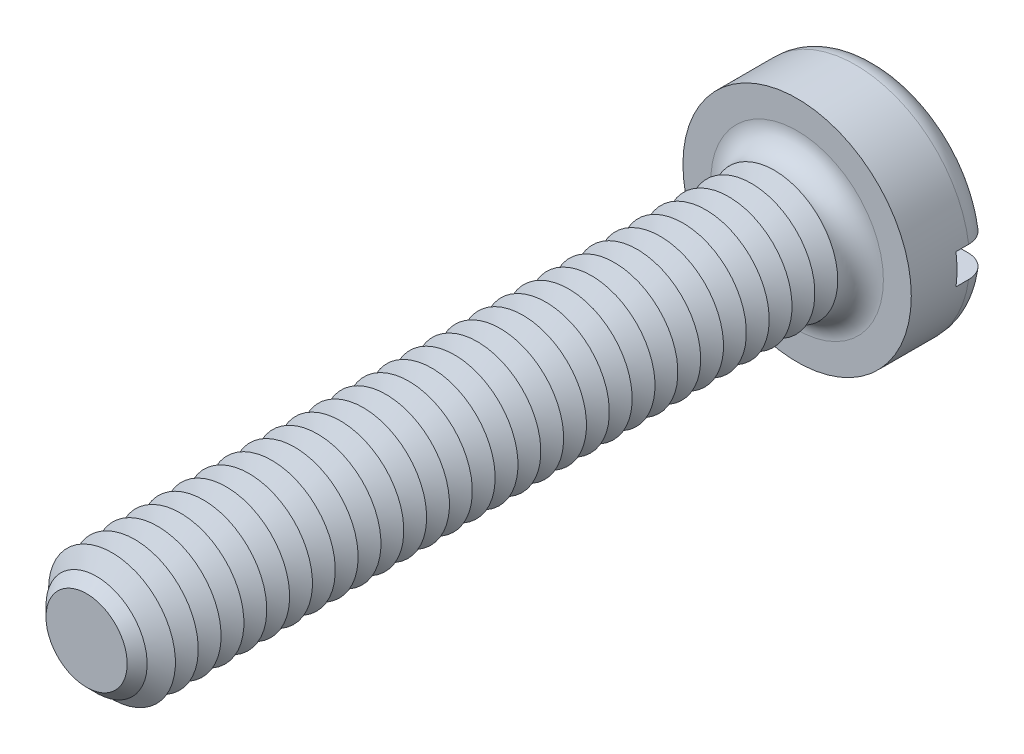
ISO-10303-21;
HEADER;
FILE_DESCRIPTION(('STEP AP214'),'2;1');
FILE_NAME('part.step','',(''),(''),'','','');
FILE_SCHEMA(('AUTOMOTIVE_DESIGN { 1 0 10303 214 1 1 1 1 }'));
ENDSEC;
DATA;
#1=APPLICATION_CONTEXT('core data for automotive mechanical design processes');
#2=APPLICATION_PROTOCOL_DEFINITION('international standard','automotive_design',2000,#1);
#3=PRODUCT_CONTEXT('',#1,'mechanical');
#4=PRODUCT('Part','Part','',(#3));
#5=PRODUCT_RELATED_PRODUCT_CATEGORY('part','',(#4));
#6=PRODUCT_DEFINITION_FORMATION('','',#4);
#7=PRODUCT_DEFINITION_CONTEXT('part definition',#1,'design');
#8=PRODUCT_DEFINITION('design','',#6,#7);
#9=PRODUCT_DEFINITION_SHAPE('','',#8);
#10=(LENGTH_UNIT() NAMED_UNIT(*) SI_UNIT(.MILLI.,.METRE.));
#11=(NAMED_UNIT(*) PLANE_ANGLE_UNIT() SI_UNIT($,.RADIAN.));
#12=(NAMED_UNIT(*) SI_UNIT($,.STERADIAN.) SOLID_ANGLE_UNIT());
#13=UNCERTAINTY_MEASURE_WITH_UNIT(LENGTH_MEASURE(1.E-05),#10,'distance_accuracy_value','');
#14=(GEOMETRIC_REPRESENTATION_CONTEXT(3) GLOBAL_UNCERTAINTY_ASSIGNED_CONTEXT((#13)) GLOBAL_UNIT_ASSIGNED_CONTEXT((#10,
#11,#12)) REPRESENTATION_CONTEXT('',''));
#15=CARTESIAN_POINT('',(0.,0.,0.));
#16=DIRECTION('',(0.,0.,1.));
#17=DIRECTION('',(1.,0.,0.));
#18=AXIS2_PLACEMENT_3D('',#15,#16,#17);
#19=CARTESIAN_POINT('',(0.,0.,-1.6));
#20=DIRECTION('',(0.,0.,1.));
#21=DIRECTION('',(1.,0.,0.));
#22=AXIS2_PLACEMENT_3D('',#19,#20,#21);
#23=PLANE('',#22);
#24=CARTESIAN_POINT('',(0.,0.,-1.6));
#25=DIRECTION('',(0.,0.,1.));
#26=DIRECTION('',(1.,0.,0.));
#27=AXIS2_PLACEMENT_3D('',#24,#25,#26);
#28=CIRCLE('',#27,1.8);
#29=CARTESIAN_POINT('',(-1.77482393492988,0.3,-1.6));
#30=VERTEX_POINT('',#29);
#31=CARTESIAN_POINT('',(1.77482393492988,0.3,-1.6));
#32=VERTEX_POINT('',#31);
#33=EDGE_CURVE('E116',#30,#32,#28,.F.);
#34=ORIENTED_EDGE('',*,*,#33,.T.);
#35=DIRECTION('',(1.,0.,0.));
#36=VECTOR('',#35,1.);
#37=CARTESIAN_POINT('',(-2.25,0.3,-1.6));
#38=LINE('',#37,#36);
#39=EDGE_CURVE('E111',#30,#32,#38,.T.);
#40=ORIENTED_EDGE('',*,*,#39,.F.);
#41=EDGE_LOOP('',(#34,#40));
#42=FACE_BOUND('',#41,.T.);
#43=ADVANCED_FACE('F39',(#42),#23,.F.);
#44=CARTESIAN_POINT('',(0.,0.,-1.15));
#45=DIRECTION('',(0.,0.,1.));
#46=DIRECTION('',(1.,0.,0.));
#47=AXIS2_PLACEMENT_3D('',#44,#45,#46);
#48=TOROIDAL_SURFACE('',#47,1.8,0.45);
#49=CARTESIAN_POINT('',(-2.09367249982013,0.3,-1.4713087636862));
#50=CARTESIAN_POINT('',(-2.07531034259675,0.3,-1.48912990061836));
#51=CARTESIAN_POINT('',(-2.05541605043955,0.3,-1.50540110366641));
#52=CARTESIAN_POINT('',(-2.01315405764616,0.3,-1.53437465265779));
#53=CARTESIAN_POINT('',(-1.99078310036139,0.3,-1.54707221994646));
#54=CARTESIAN_POINT('',(-1.94425163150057,0.3,-1.56853090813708));
#55=CARTESIAN_POINT('',(-1.92009286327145,0.3,-1.57729580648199));
#56=CARTESIAN_POINT('',(-1.8706617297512,0.3,-1.59068015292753));
#57=CARTESIAN_POINT('',(-1.84538964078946,0.3,-1.59530062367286));
#58=CARTESIAN_POINT('',(-1.7942134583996,0.3,-1.60031507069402));
#59=CARTESIAN_POINT('',(-1.76830582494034,0.3,-1.60067291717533));
#60=CARTESIAN_POINT('',(-1.71679040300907,0.3,-1.59707477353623));
#61=CARTESIAN_POINT('',(-1.69118264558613,0.3,-1.59311834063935));
#62=CARTESIAN_POINT('',(-1.64075792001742,0.3,-1.58095464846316));
#63=CARTESIAN_POINT('',(-1.61594989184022,0.3,-1.57271029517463));
#64=CARTESIAN_POINT('',(-1.56806655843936,0.3,-1.55217762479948));
#65=CARTESIAN_POINT('',(-1.54499130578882,0.3,-1.53988918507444));
#66=CARTESIAN_POINT('',(-1.50122413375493,0.3,-1.51158963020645));
#67=CARTESIAN_POINT('',(-1.48053389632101,0.3,-1.49557591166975));
#68=CARTESIAN_POINT('',(-1.44217532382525,0.3,-1.46026359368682));
#69=CARTESIAN_POINT('',(-1.42450683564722,0.3,-1.4409651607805));
#70=CARTESIAN_POINT('',(-1.39293961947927,0.3,-1.39986821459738));
#71=CARTESIAN_POINT('',(-1.37899788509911,0.3,-1.37810275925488));
#72=CARTESIAN_POINT('',(-1.35506190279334,0.3,-1.33249939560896));
#73=CARTESIAN_POINT('',(-1.34506709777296,0.3,-1.30866178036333));
#74=CARTESIAN_POINT('',(-1.3295415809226,0.3,-1.26015137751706));
#75=CARTESIAN_POINT('',(-1.32391771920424,0.3,-1.23550839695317));
#76=CARTESIAN_POINT('',(-1.31696995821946,0.3,-1.18562442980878));
#77=CARTESIAN_POINT('',(-1.31564552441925,0.3,-1.16038351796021));
#78=CARTESIAN_POINT('',(-1.31732714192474,0.3,-1.11049178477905));
#79=CARTESIAN_POINT('',(-1.32025766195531,0.3,-1.08583837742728));
#80=CARTESIAN_POINT('',(-1.3302124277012,0.3,-1.03737369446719));
#81=CARTESIAN_POINT('',(-1.33723664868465,0.3,-1.01356241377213));
#82=CARTESIAN_POINT('',(-1.35515820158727,0.3,-0.967413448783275));
#83=CARTESIAN_POINT('',(-1.36606032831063,0.3,-0.945077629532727));
#84=CARTESIAN_POINT('',(-1.39139351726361,0.3,-0.902507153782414));
#85=CARTESIAN_POINT('',(-1.40582489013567,0.3,-0.882272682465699));
#86=CARTESIAN_POINT('',(-1.43808691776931,0.3,-0.844072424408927));
#87=CARTESIAN_POINT('',(-1.4559757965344,0.3,-0.826155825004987));
#88=CARTESIAN_POINT('',(-1.49445205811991,0.3,-0.793502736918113));
#89=CARTESIAN_POINT('',(-1.51503974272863,0.3,-0.778766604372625));
#90=CARTESIAN_POINT('',(-1.55880475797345,0.3,-0.752571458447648));
#91=CARTESIAN_POINT('',(-1.58202794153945,0.3,-0.741189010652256));
#92=CARTESIAN_POINT('',(-1.63004083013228,0.3,-0.722432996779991));
#93=CARTESIAN_POINT('',(-1.65483064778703,0.3,-0.715059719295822));
#94=CARTESIAN_POINT('',(-1.70558060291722,0.3,-0.704463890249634));
#95=CARTESIAN_POINT('',(-1.73155090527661,0.3,-0.701289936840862));
#96=CARTESIAN_POINT('',(-1.78365633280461,0.3,-0.699350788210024));
#97=CARTESIAN_POINT('',(-1.80979145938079,0.3,-0.700585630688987));
#98=CARTESIAN_POINT('',(-1.86145503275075,0.3,-0.70744393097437));
#99=CARTESIAN_POINT('',(-1.88698403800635,0.3,-0.713063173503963));
#100=CARTESIAN_POINT('',(-1.93672112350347,0.3,-0.728546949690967));
#101=CARTESIAN_POINT('',(-1.96092925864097,0.3,-0.738411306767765));
#102=CARTESIAN_POINT('',(-2.00710191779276,0.3,-0.762015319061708));
#103=CARTESIAN_POINT('',(-2.02908465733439,0.3,-0.775719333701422));
#104=CARTESIAN_POINT('',(-2.0704025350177,0.3,-0.806663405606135));
#105=CARTESIAN_POINT('',(-2.08973782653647,0.3,-0.823903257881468));
#106=CARTESIAN_POINT('',(-2.12497879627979,0.3,-0.861218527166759));
#107=CARTESIAN_POINT('',(-2.1409209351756,0.3,-0.881259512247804));
#108=CARTESIAN_POINT('',(-2.16917502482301,0.3,-0.92375535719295));
#109=CARTESIAN_POINT('',(-2.18148717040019,0.3,-0.946210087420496));
#110=CARTESIAN_POINT('',(-2.20201023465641,0.3,-0.99266079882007));
#111=CARTESIAN_POINT('',(-2.21025973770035,0.3,-1.01663973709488));
#112=CARTESIAN_POINT('',(-2.22258852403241,0.3,-1.06564563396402));
#113=CARTESIAN_POINT('',(-2.22666813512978,0.3,-1.0906725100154));
#114=CARTESIAN_POINT('',(-2.23052418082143,0.3,-1.14090288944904));
#115=CARTESIAN_POINT('',(-2.23032644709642,0.3,-1.16610441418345));
#116=CARTESIAN_POINT('',(-2.22569614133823,0.3,-1.21612212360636));
#117=CARTESIAN_POINT('',(-2.2212625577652,0.3,-1.24093821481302));
#118=CARTESIAN_POINT('',(-2.20829785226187,0.3,-1.2894516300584));
#119=CARTESIAN_POINT('',(-2.19976997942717,0.3,-1.31314982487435));
#120=CARTESIAN_POINT('',(-2.17887390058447,0.3,-1.35876313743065));
#121=CARTESIAN_POINT('',(-2.1665103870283,0.3,-1.3806803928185));
#122=CARTESIAN_POINT('',(-2.14384463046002,0.3,-1.4140108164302));
#123=CARTESIAN_POINT('',(-2.13462949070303,0.3,-1.42617780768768));
#124=CARTESIAN_POINT('',(-2.1150151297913,0.3,-1.44951629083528));
#125=CARTESIAN_POINT('',(-2.10461591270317,0.3,-1.46068778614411));
#126=CARTESIAN_POINT('',(-2.09367249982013,0.3,-1.4713087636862));
#127=B_SPLINE_CURVE_WITH_KNOTS('',3,(#49,#50,#51,#52,#53,#54,#55,#56,#57,#58,#59,#60,#61,#62,
#63,#64,#65,#66,#67,#68,#69,#70,#71,#72,#73,#74,#75,#76,#77,#78,#79,#80,#81,#82,#83,#84,#85,#86,
#87,#88,#89,#90,#91,#92,#93,#94,#95,#96,#97,#98,#99,#100,#101,#102,#103,#104,#105,#106,#107,
#108,#109,#110,#111,#112,#113,#114,#115,#116,#117,#118,#119,#120,#121,#122,#123,#124,#125,#126),
.UNSPECIFIED.,.T.,.F.,(4,2,2,2,2,2,2,2,2,2,2,2,2,2,2,2,2,2,2,2,2,2,2,2,2,2,2,2,2,2,2,2,2,2,2,2,
2,2,4),(0.,0.0767085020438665,0.153519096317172,0.230255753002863,0.306973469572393,
0.384340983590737,0.461716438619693,0.539772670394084,0.617831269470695,0.695944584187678,
0.774053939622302,0.851218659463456,0.928372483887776,1.00383319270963,1.07928451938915,
1.15341274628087,1.22754052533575,1.30176027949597,1.37598656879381,1.45159320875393,
1.52720831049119,1.6044355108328,1.68166826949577,1.75978723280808,1.8379068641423,
1.91595148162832,1.99399285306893,2.07133254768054,2.14866775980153,2.22512456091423,
2.30157725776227,2.3772891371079,2.45299506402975,2.52824391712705,2.60351074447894,
2.67871794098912,2.75383349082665,2.79955010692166,2.84526656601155),.UNSPECIFIED.);
#128=CARTESIAN_POINT('',(-2.22991031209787,0.3,-1.14999999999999));
#129=VERTEX_POINT('',#128);
#130=EDGE_CURVE('E425',#129,#30,#127,.T.);
#131=ORIENTED_EDGE('',*,*,#130,.F.);
#132=CARTESIAN_POINT('',(0.,0.,-1.15));
#133=DIRECTION('',(0.,0.,1.));
#134=DIRECTION('',(1.,0.,0.));
#135=AXIS2_PLACEMENT_3D('',#132,#133,#134);
#136=CIRCLE('',#135,2.25);
#137=CARTESIAN_POINT('',(2.22991031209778,0.3,-1.15));
#138=VERTEX_POINT('',#137);
#139=EDGE_CURVE('E125',#138,#129,#136,.T.);
#140=ORIENTED_EDGE('',*,*,#139,.F.);
#141=CARTESIAN_POINT('',(1.39325818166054,0.3,-1.39903402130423));
#142=CARTESIAN_POINT('',(1.40771723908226,0.3,-1.42030595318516));
#143=CARTESIAN_POINT('',(1.4240122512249,0.3,-1.4403555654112));
#144=CARTESIAN_POINT('',(1.45976320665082,0.3,-1.4774406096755));
#145=CARTESIAN_POINT('',(1.47922380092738,0.3,-1.49447152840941));
#146=CARTESIAN_POINT('',(1.5206923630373,0.3,-1.52502510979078));
#147=CARTESIAN_POINT('',(1.54269721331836,0.3,-1.53855200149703));
#148=CARTESIAN_POINT('',(1.58863815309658,0.3,-1.56176272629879));
#149=CARTESIAN_POINT('',(1.61257369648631,0.3,-1.57144764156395));
#150=CARTESIAN_POINT('',(1.66199169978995,0.3,-1.58680804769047));
#151=CARTESIAN_POINT('',(1.68748839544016,0.3,-1.59243778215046));
#152=CARTESIAN_POINT('',(1.73906656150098,0.3,-1.59934902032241));
#153=CARTESIAN_POINT('',(1.76514807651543,0.3,-1.60063019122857));
#154=CARTESIAN_POINT('',(1.81721740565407,0.3,-1.59879130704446));
#155=CARTESIAN_POINT('',(1.84320486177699,0.3,-1.59566102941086));
#156=CARTESIAN_POINT('',(1.89427635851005,0.3,-1.58504931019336));
#157=CARTESIAN_POINT('',(1.91936042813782,0.3,-1.57756800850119));
#158=CARTESIAN_POINT('',(1.9677137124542,0.3,-1.55851722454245));
#159=CARTESIAN_POINT('',(1.99099484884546,0.3,-1.5469780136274));
#160=CARTESIAN_POINT('',(2.03525897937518,0.3,-1.52011224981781));
#161=CARTESIAN_POINT('',(2.05624211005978,0.3,-1.50478592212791));
#162=CARTESIAN_POINT('',(2.09506403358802,0.3,-1.47096472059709));
#163=CARTESIAN_POINT('',(2.11293536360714,0.3,-1.45250719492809));
#164=CARTESIAN_POINT('',(2.14528563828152,0.3,-1.41282609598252));
#165=CARTESIAN_POINT('',(2.15976477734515,0.3,-1.39160268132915));
#166=CARTESIAN_POINT('',(2.18476262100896,0.3,-1.34723254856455));
#167=CARTESIAN_POINT('',(2.19532119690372,0.3,-1.32410828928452));
#168=CARTESIAN_POINT('',(2.21237438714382,0.3,-1.27640693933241));
#169=CARTESIAN_POINT('',(2.21886918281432,0.3,-1.25182991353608));
#170=CARTESIAN_POINT('',(2.2275687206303,0.3,-1.20210937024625));
#171=CARTESIAN_POINT('',(2.22980376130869,0.3,-1.17697115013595));
#172=CARTESIAN_POINT('',(2.23000940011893,0.3,-1.12667754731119));
#173=CARTESIAN_POINT('',(2.22798009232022,0.3,-1.10152216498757));
#174=CARTESIAN_POINT('',(2.21972856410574,0.3,-1.05197773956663));
#175=CARTESIAN_POINT('',(2.21351744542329,0.3,-1.02758684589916));
#176=CARTESIAN_POINT('',(2.19709696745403,0.3,-0.980190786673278));
#177=CARTESIAN_POINT('',(2.18688760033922,0.3,-0.957185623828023));
#178=CARTESIAN_POINT('',(2.1627435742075,0.3,-0.913157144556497));
#179=CARTESIAN_POINT('',(2.14880093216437,0.3,-0.892138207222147));
#180=CARTESIAN_POINT('',(2.11760640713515,0.3,-0.852719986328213));
#181=CARTESIAN_POINT('',(2.10035443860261,0.3,-0.834320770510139));
#182=CARTESIAN_POINT('',(2.06291254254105,0.3,-0.80052923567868));
#183=CARTESIAN_POINT('',(2.04270386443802,0.3,-0.785157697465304));
#184=CARTESIAN_POINT('',(2.0000139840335,0.3,-0.757986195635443));
#185=CARTESIAN_POINT('',(1.97753267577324,0.3,-0.746186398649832));
#186=CARTESIAN_POINT('',(1.93069507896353,0.3,-0.726364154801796));
#187=CARTESIAN_POINT('',(1.90632219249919,0.3,-0.718380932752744));
#188=CARTESIAN_POINT('',(1.85658993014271,0.3,-0.706569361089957));
#189=CARTESIAN_POINT('',(1.83123049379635,0.3,-0.702741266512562));
#190=CARTESIAN_POINT('',(1.77994107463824,0.3,-0.699306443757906));
#191=CARTESIAN_POINT('',(1.75400788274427,0.3,-0.69974759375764));
#192=CARTESIAN_POINT('',(1.70257608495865,0.3,-0.704939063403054));
#193=CARTESIAN_POINT('',(1.67707750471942,0.3,-0.709689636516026));
#194=CARTESIAN_POINT('',(1.62701662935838,0.3,-0.723419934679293));
#195=CARTESIAN_POINT('',(1.60246387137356,0.3,-0.732434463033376));
#196=CARTESIAN_POINT('',(1.55521886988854,0.3,-0.754458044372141));
#197=CARTESIAN_POINT('',(1.53252668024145,0.3,-0.76746721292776));
#198=CARTESIAN_POINT('',(1.48966925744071,0.3,-0.797124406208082));
#199=CARTESIAN_POINT('',(1.46950315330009,0.3,-0.813771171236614));
#200=CARTESIAN_POINT('',(1.43229728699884,0.3,-0.850255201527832));
#201=CARTESIAN_POINT('',(1.41525734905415,0.3,-0.870092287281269));
#202=CARTESIAN_POINT('',(1.3850470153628,0.3,-0.912123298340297));
#203=CARTESIAN_POINT('',(1.37182821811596,0.3,-0.934282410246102));
#204=CARTESIAN_POINT('',(1.34939737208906,0.3,-0.980542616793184));
#205=CARTESIAN_POINT('',(1.34018456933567,0.3,-1.00464334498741));
#206=CARTESIAN_POINT('',(1.32624172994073,0.3,-1.05352472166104));
#207=CARTESIAN_POINT('',(1.32141599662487,0.3,-1.07827808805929));
#208=CARTESIAN_POINT('',(1.31606478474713,0.3,-1.12825155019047));
#209=CARTESIAN_POINT('',(1.31553992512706,0.3,-1.15347171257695));
#210=CARTESIAN_POINT('',(1.31878307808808,0.3,-1.20323022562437));
#211=CARTESIAN_POINT('',(1.32248353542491,0.3,-1.22777305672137));
#212=CARTESIAN_POINT('',(1.33394086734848,0.3,-1.27586981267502));
#213=CARTESIAN_POINT('',(1.34169274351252,0.3,-1.2994249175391));
#214=CARTESIAN_POINT('',(1.35704250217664,0.3,-1.33561898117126));
#215=CARTESIAN_POINT('',(1.36341395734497,0.3,-1.34879219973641));
#216=CARTESIAN_POINT('',(1.37741190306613,0.3,-1.37445328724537));
#217=CARTESIAN_POINT('',(1.38503837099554,0.3,-1.38694116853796));
#218=CARTESIAN_POINT('',(1.39325818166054,0.3,-1.39903402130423));
#219=B_SPLINE_CURVE_WITH_KNOTS('',3,(#141,#142,#143,#144,#145,#146,#147,#148,#149,#150,#151,
#152,#153,#154,#155,#156,#157,#158,#159,#160,#161,#162,#163,#164,#165,#166,#167,#168,#169,#170,
#171,#172,#173,#174,#175,#176,#177,#178,#179,#180,#181,#182,#183,#184,#185,#186,#187,#188,#189,
#190,#191,#192,#193,#194,#195,#196,#197,#198,#199,#200,#201,#202,#203,#204,#205,#206,#207,#208,
#209,#210,#211,#212,#213,#214,#215,#216,#217,#218),.UNSPECIFIED.,.T.,.F.,(4,2,2,2,2,2,2,2,2,2,2,
2,2,2,2,2,2,2,2,2,2,2,2,2,2,2,2,2,2,2,2,2,2,2,2,2,2,2,4),(0.,0.0771077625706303,
0.154329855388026,0.231458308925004,0.308565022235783,0.386528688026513,0.464498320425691,
0.542648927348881,0.620797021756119,0.698374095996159,0.77594655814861,0.852651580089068,
0.929352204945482,1.00524992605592,1.08114426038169,1.15649673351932,1.2318475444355,
1.30699910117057,1.38215080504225,1.45746451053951,1.53278016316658,1.60859599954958,
1.68441537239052,1.76099806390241,1.83758545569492,1.91503273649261,1.99248457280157,
2.07057979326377,2.14867727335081,2.22674775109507,2.30481383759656,2.38184276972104,
2.45885719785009,2.53414829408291,2.6094502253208,2.68356487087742,2.75758829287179,
2.80142397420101,2.84525886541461),.UNSPECIFIED.);
#220=EDGE_CURVE('E427',#32,#138,#219,.T.);
#221=ORIENTED_EDGE('',*,*,#220,.F.);
#222=ORIENTED_EDGE('',*,*,#33,.F.);
#223=EDGE_LOOP('',(#131,#140,#221,#222));
#224=FACE_BOUND('',#223,.T.);
#225=ADVANCED_FACE('F409',(#224),#48,.T.);
#226=CARTESIAN_POINT('',(0.,0.,-1.6));
#227=DIRECTION('',(0.,0.,1.));
#228=DIRECTION('',(1.,0.,0.));
#229=AXIS2_PLACEMENT_3D('',#226,#227,#228);
#230=CYLINDRICAL_SURFACE('',#229,2.25);
#231=DIRECTION('',(0.,0.,1.));
#232=VECTOR('',#231,1.);
#233=CARTESIAN_POINT('',(2.22991031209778,0.3,-1.6));
#234=LINE('',#233,#232);
#235=CARTESIAN_POINT('',(2.22991031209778,0.3,-0.9));
#236=VERTEX_POINT('',#235);
#237=EDGE_CURVE('E443',#138,#236,#234,.T.);
#238=ORIENTED_EDGE('',*,*,#237,.F.);
#239=ORIENTED_EDGE('',*,*,#139,.T.);
#240=DIRECTION('',(0.,0.,1.));
#241=VECTOR('',#240,1.);
#242=CARTESIAN_POINT('',(-2.22991031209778,0.3,-1.6));
#243=LINE('',#242,#241);
#244=CARTESIAN_POINT('',(-2.22991031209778,0.3,-0.9));
#245=VERTEX_POINT('',#244);
#246=EDGE_CURVE('E63',#245,#129,#243,.F.);
#247=ORIENTED_EDGE('',*,*,#246,.F.);
#248=CARTESIAN_POINT('',(0.,0.,-0.9));
#249=DIRECTION('',(0.,0.,-1.));
#250=DIRECTION('',(-1.,0.,0.));
#251=AXIS2_PLACEMENT_3D('',#248,#249,#250);
#252=CIRCLE('',#251,2.25);
#253=CARTESIAN_POINT('',(-2.22991031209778,-0.3,-0.9));
#254=VERTEX_POINT('',#253);
#255=EDGE_CURVE('E43',#245,#254,#252,.F.);
#256=ORIENTED_EDGE('',*,*,#255,.T.);
#257=DIRECTION('',(0.,0.,1.));
#258=VECTOR('',#257,1.);
#259=CARTESIAN_POINT('',(-2.22991031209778,-0.3,-1.6));
#260=LINE('',#259,#258);
#261=CARTESIAN_POINT('',(-2.22991031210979,-0.3,-1.15000000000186));
#262=VERTEX_POINT('',#261);
#263=EDGE_CURVE('E440',#262,#254,#260,.T.);
#264=ORIENTED_EDGE('',*,*,#263,.F.);
#265=CARTESIAN_POINT('',(2.22991031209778,-0.3,-1.15));
#266=VERTEX_POINT('',#265);
#267=EDGE_CURVE('E127',#262,#266,#136,.T.);
#268=ORIENTED_EDGE('',*,*,#267,.T.);
#269=DIRECTION('',(0.,0.,1.));
#270=VECTOR('',#269,1.);
#271=CARTESIAN_POINT('',(2.22991031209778,-0.3,-1.6));
#272=LINE('',#271,#270);
#273=CARTESIAN_POINT('',(2.22991031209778,-0.3,-0.9));
#274=VERTEX_POINT('',#273);
#275=EDGE_CURVE('E55',#274,#266,#272,.F.);
#276=ORIENTED_EDGE('',*,*,#275,.F.);
#277=EDGE_CURVE('E11',#274,#236,#252,.F.);
#278=ORIENTED_EDGE('',*,*,#277,.T.);
#279=EDGE_LOOP('',(#238,#239,#247,#256,#264,#268,#276,#278));
#280=FACE_BOUND('',#279,.T.);
#281=CARTESIAN_POINT('',(0.,0.,0.));
#282=DIRECTION('',(0.,0.,1.));
#283=DIRECTION('',(1.,0.,0.));
#284=AXIS2_PLACEMENT_3D('',#281,#282,#283);
#285=CIRCLE('',#284,2.25);
#286=CARTESIAN_POINT('',(2.25,0.,0.));
#287=VERTEX_POINT('',#286);
#288=EDGE_CURVE('E446',#287,#287,#285,.T.);
#289=ORIENTED_EDGE('',*,*,#288,.F.);
#290=EDGE_LOOP('',(#289));
#291=FACE_BOUND('',#290,.T.);
#292=ADVANCED_FACE('F405',(#280,#291),#230,.T.);
#293=CARTESIAN_POINT('',(1.77482393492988,-0.3,-1.6));
#294=VERTEX_POINT('',#293);
#295=CARTESIAN_POINT('',(-1.77482393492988,-0.3,-1.6));
#296=VERTEX_POINT('',#295);
#297=EDGE_CURVE('E109',#294,#296,#28,.F.);
#298=ORIENTED_EDGE('',*,*,#297,.T.);
#299=DIRECTION('',(-1.,0.,0.));
#300=VECTOR('',#299,1.);
#301=CARTESIAN_POINT('',(-2.25,-0.3,-1.6));
#302=LINE('',#301,#300);
#303=EDGE_CURVE('E96',#294,#296,#302,.T.);
#304=ORIENTED_EDGE('',*,*,#303,.F.);
#305=EDGE_LOOP('',(#298,#304));
#306=FACE_BOUND('',#305,.T.);
#307=ADVANCED_FACE('F108',(#306),#23,.F.);
#308=CARTESIAN_POINT('',(0.,0.,0.));
#309=DIRECTION('',(0.,0.,1.));
#310=DIRECTION('',(1.,0.,0.));
#311=AXIS2_PLACEMENT_3D('',#308,#309,#310);
#312=PLANE('',#311);
#313=CARTESIAN_POINT('',(0.,0.,0.));
#314=DIRECTION('',(0.,0.,1.));
#315=DIRECTION('',(1.,0.,0.));
#316=AXIS2_PLACEMENT_3D('',#313,#314,#315);
#317=CIRCLE('',#316,1.7);
#318=CARTESIAN_POINT('',(1.7,0.,0.));
#319=VERTEX_POINT('',#318);
#320=EDGE_CURVE('E115',#319,#319,#317,.F.);
#321=ORIENTED_EDGE('',*,*,#320,.T.);
#322=EDGE_LOOP('',(#321));
#323=FACE_BOUND('',#322,.T.);
#324=ORIENTED_EDGE('',*,*,#288,.T.);
#325=EDGE_LOOP('',(#324));
#326=FACE_BOUND('',#325,.T.);
#327=ADVANCED_FACE('F404',(#323,#326),#312,.T.);
#328=CARTESIAN_POINT('',(-2.09367249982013,-0.3,-1.4713087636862));
#329=CARTESIAN_POINT('',(-2.11176539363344,-0.3,-1.45374579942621));
#330=CARTESIAN_POINT('',(-2.1283968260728,-0.3,-1.43465254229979));
#331=CARTESIAN_POINT('',(-2.15823692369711,-0.3,-1.39393307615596));
#332=CARTESIAN_POINT('',(-2.17144184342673,-0.3,-1.37230413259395));
#333=CARTESIAN_POINT('',(-2.19402281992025,-0.3,-1.32713362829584));
#334=CARTESIAN_POINT('',(-2.20339951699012,-0.3,-1.30359238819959));
#335=CARTESIAN_POINT('',(-2.21804409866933,-0.3,-1.25527081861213));
#336=CARTESIAN_POINT('',(-2.22331295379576,-0.3,-1.23049078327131));
#337=CARTESIAN_POINT('',(-2.22957448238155,-0.3,-1.18050893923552));
#338=CARTESIAN_POINT('',(-2.23058617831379,-0.3,-1.15530951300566));
#339=CARTESIAN_POINT('',(-2.22835535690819,-0.3,-1.10509920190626));
#340=CARTESIAN_POINT('',(-2.22511277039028,-0.3,-1.08008832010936));
#341=CARTESIAN_POINT('',(-2.21448018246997,-0.3,-1.03101646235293));
#342=CARTESIAN_POINT('',(-2.20709836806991,-0.3,-1.00695371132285));
#343=CARTESIAN_POINT('',(-2.18841075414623,-0.3,-0.960404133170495));
#344=CARTESIAN_POINT('',(-2.17710493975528,-0.3,-0.937917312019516));
#345=CARTESIAN_POINT('',(-2.15086234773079,-0.3,-0.895085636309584));
#346=CARTESIAN_POINT('',(-2.13591537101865,-0.3,-0.874747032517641));
#347=CARTESIAN_POINT('',(-2.1028415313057,-0.3,-0.836845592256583));
#348=CARTESIAN_POINT('',(-2.08471458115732,-0.3,-0.819282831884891));
#349=CARTESIAN_POINT('',(-2.0456590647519,-0.3,-0.78729174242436));
#350=CARTESIAN_POINT('',(-2.0247112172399,-0.3,-0.772886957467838));
#351=CARTESIAN_POINT('',(-1.98071452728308,-0.3,-0.747756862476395));
#352=CARTESIAN_POINT('',(-1.95766557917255,-0.3,-0.737031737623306));
#353=CARTESIAN_POINT('',(-1.90986554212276,-0.3,-0.71944451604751));
#354=CARTESIAN_POINT('',(-1.88509923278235,-0.3,-0.712623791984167));
#355=CARTESIAN_POINT('',(-1.83477837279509,-0.3,-0.703186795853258));
#356=CARTESIAN_POINT('',(-1.80922377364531,-0.3,-0.700570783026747));
#357=CARTESIAN_POINT('',(-1.75774893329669,-0.3,-0.699591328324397));
#358=CARTESIAN_POINT('',(-1.73182778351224,-0.3,-0.701275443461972));
#359=CARTESIAN_POINT('',(-1.68062744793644,-0.3,-0.708937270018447));
#360=CARTESIAN_POINT('',(-1.65534829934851,-0.3,-0.714915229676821));
#361=CARTESIAN_POINT('',(-1.6059539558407,-0.3,-0.731056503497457));
#362=CARTESIAN_POINT('',(-1.58184881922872,-0.3,-0.741250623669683));
#363=CARTESIAN_POINT('',(-1.53569497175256,-0.3,-0.765548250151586));
#364=CARTESIAN_POINT('',(-1.51364629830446,-0.3,-0.779651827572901));
#365=CARTESIAN_POINT('',(-1.47229470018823,-0.3,-0.811355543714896));
#366=CARTESIAN_POINT('',(-1.45298625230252,-0.3,-0.828948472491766));
#367=CARTESIAN_POINT('',(-1.41765142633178,-0.3,-0.867170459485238));
#368=CARTESIAN_POINT('',(-1.40162480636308,-0.3,-0.887799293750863));
#369=CARTESIAN_POINT('',(-1.37358365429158,-0.3,-0.93118317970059));
#370=CARTESIAN_POINT('',(-1.3615121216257,-0.3,-0.953901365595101));
#371=CARTESIAN_POINT('',(-1.34145576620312,-0.3,-1.00107529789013));
#372=CARTESIAN_POINT('',(-1.33347032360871,-0.3,-1.02553078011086));
#373=CARTESIAN_POINT('',(-1.32199536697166,-0.3,-1.07489401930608));
#374=CARTESIAN_POINT('',(-1.31840873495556,-0.3,-1.09977921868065));
#375=CARTESIAN_POINT('',(-1.31553052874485,-0.3,-1.1497957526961));
#376=CARTESIAN_POINT('',(-1.31623852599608,-0.3,-1.17492706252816));
#377=CARTESIAN_POINT('',(-1.32188368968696,-0.3,-1.22435119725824));
#378=CARTESIAN_POINT('',(-1.32676151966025,-0.3,-1.24865083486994));
#379=CARTESIAN_POINT('',(-1.34050334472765,-0.3,-1.29609421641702));
#380=CARTESIAN_POINT('',(-1.34936742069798,-0.3,-1.31923793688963));
#381=CARTESIAN_POINT('',(-1.37086295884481,-0.3,-1.36387796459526));
#382=CARTESIAN_POINT('',(-1.38351729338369,-0.3,-1.38536324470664));
#383=CARTESIAN_POINT('',(-1.41218367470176,-0.3,-1.42596199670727));
#384=CARTESIAN_POINT('',(-1.42819606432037,-0.3,-1.44507522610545));
#385=CARTESIAN_POINT('',(-1.46347664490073,-0.3,-1.48081087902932));
#386=CARTESIAN_POINT('',(-1.48280543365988,-0.3,-1.49737347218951));
#387=CARTESIAN_POINT('',(-1.5239232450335,-0.3,-1.52709508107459));
#388=CARTESIAN_POINT('',(-1.54571253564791,-0.3,-1.54025372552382));
#389=CARTESIAN_POINT('',(-1.59160097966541,-0.3,-1.56305446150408));
#390=CARTESIAN_POINT('',(-1.61573734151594,-0.3,-1.57262172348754));
#391=CARTESIAN_POINT('',(-1.66526504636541,-0.3,-1.58760700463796));
#392=CARTESIAN_POINT('',(-1.69065641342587,-0.3,-1.59302494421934));
#393=CARTESIAN_POINT('',(-1.74220154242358,-0.3,-1.59958446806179));
#394=CARTESIAN_POINT('',(-1.7683598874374,-0.3,-1.60069012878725));
#395=CARTESIAN_POINT('',(-1.82049681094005,-0.3,-1.59847888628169));
#396=CARTESIAN_POINT('',(-1.8464753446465,-0.3,-1.59516091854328));
#397=CARTESIAN_POINT('',(-1.89742078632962,-0.3,-1.58419269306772));
#398=CARTESIAN_POINT('',(-1.92239041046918,-0.3,-1.57655503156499));
#399=CARTESIAN_POINT('',(-1.97064988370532,-0.3,-1.55715679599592));
#400=CARTESIAN_POINT('',(-1.99394179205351,-0.3,-1.54540138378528));
#401=CARTESIAN_POINT('',(-2.03003215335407,-0.3,-1.52312594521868));
#402=CARTESIAN_POINT('',(-2.04354254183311,-0.3,-1.51373809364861));
#403=CARTESIAN_POINT('',(-2.06946640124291,-0.3,-1.49355310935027));
#404=CARTESIAN_POINT('',(-2.08187987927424,-0.3,-1.48275598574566));
#405=CARTESIAN_POINT('',(-2.09367249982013,-0.3,-1.4713087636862));
#406=B_SPLINE_CURVE_WITH_KNOTS('',3,(#328,#329,#330,#331,#332,#333,#334,#335,#336,#337,#338,
#339,#340,#341,#342,#343,#344,#345,#346,#347,#348,#349,#350,#351,#352,#353,#354,#355,#356,#357,
#358,#359,#360,#361,#362,#363,#364,#365,#366,#367,#368,#369,#370,#371,#372,#373,#374,#375,#376,
#377,#378,#379,#380,#381,#382,#383,#384,#385,#386,#387,#388,#389,#390,#391,#392,#393,#394,#395,
#396,#397,#398,#399,#400,#401,#402,#403,#404,#405),.UNSPECIFIED.,.T.,.F.,(4,2,2,2,2,2,2,2,2,2,2,
2,2,2,2,2,2,2,2,2,2,2,2,2,2,2,2,2,2,2,2,2,2,2,2,2,2,2,4),(0.,0.0755864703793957,
0.151255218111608,0.226911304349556,0.302549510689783,0.377849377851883,0.453150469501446,
0.528303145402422,0.603456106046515,0.67882204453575,0.754190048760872,0.83010216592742,
0.906018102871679,0.982724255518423,1.05943513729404,1.13699806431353,1.21456547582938,
1.29270994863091,1.37085584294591,1.44884191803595,1.52682224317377,1.60362346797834,
1.68041303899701,1.75547480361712,1.83052907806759,1.90453278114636,1.97853798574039,
2.05299909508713,2.12746781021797,2.20347986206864,2.27950020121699,2.3570265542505,
2.43455439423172,2.5127267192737,2.59091785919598,2.66888216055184,2.74674907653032,
2.79601528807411,2.84528118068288),.UNSPECIFIED.);
#407=EDGE_CURVE('E103',#296,#262,#406,.T.);
#408=ORIENTED_EDGE('',*,*,#407,.F.);
#409=ORIENTED_EDGE('',*,*,#297,.F.);
#410=CARTESIAN_POINT('',(1.39325818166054,-0.3,-1.39903402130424));
#411=CARTESIAN_POINT('',(1.37924349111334,-0.3,-1.37841200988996));
#412=CARTESIAN_POINT('',(1.36693374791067,-0.3,-1.35661225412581));
#413=CARTESIAN_POINT('',(1.34612289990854,-0.3,-1.31124547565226));
#414=CARTESIAN_POINT('',(1.33762533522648,-0.3,-1.28767683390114));
#415=CARTESIAN_POINT('',(1.32472877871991,-0.3,-1.23943261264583));
#416=CARTESIAN_POINT('',(1.3203309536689,-0.3,-1.21475672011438));
#417=CARTESIAN_POINT('',(1.31579198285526,-0.3,-1.16502199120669));
#418=CARTESIAN_POINT('',(1.31564980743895,-0.3,-1.13996324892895));
#419=CARTESIAN_POINT('',(1.31960322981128,-0.3,-1.09044336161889));
#420=CARTESIAN_POINT('',(1.32365524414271,-0.3,-1.06597872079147));
#421=CARTESIAN_POINT('',(1.33579339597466,-0.3,-1.01807218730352));
#422=CARTESIAN_POINT('',(1.34387971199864,-0.3,-0.994630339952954));
#423=CARTESIAN_POINT('',(1.36386460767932,-0.3,-0.949319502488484));
#424=CARTESIAN_POINT('',(1.37577869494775,-0.3,-0.92745736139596));
#425=CARTESIAN_POINT('',(1.40303929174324,-0.3,-0.885990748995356));
#426=CARTESIAN_POINT('',(1.41838612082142,-0.3,-0.866386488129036));
#427=CARTESIAN_POINT('',(1.45239955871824,-0.3,-0.829572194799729));
#428=CARTESIAN_POINT('',(1.47112624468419,-0.3,-0.812417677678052));
#429=CARTESIAN_POINT('',(1.51114353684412,-0.3,-0.78141873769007));
#430=CARTESIAN_POINT('',(1.53243442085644,-0.3,-0.767574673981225));
#431=CARTESIAN_POINT('',(1.57744959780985,-0.3,-0.743302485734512));
#432=CARTESIAN_POINT('',(1.6012148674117,-0.3,-0.732950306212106));
#433=CARTESIAN_POINT('',(1.65013556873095,-0.3,-0.71633816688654));
#434=CARTESIAN_POINT('',(1.67529109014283,-0.3,-0.710078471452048));
#435=CARTESIAN_POINT('',(1.72654223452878,-0.3,-0.701786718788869));
#436=CARTESIAN_POINT('',(1.75264462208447,-0.3,-0.699796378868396));
#437=CARTESIAN_POINT('',(1.80481283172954,-0.3,-0.700236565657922));
#438=CARTESIAN_POINT('',(1.83087865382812,-0.3,-0.702667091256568));
#439=CARTESIAN_POINT('',(1.88216421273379,-0.3,-0.71188843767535));
#440=CARTESIAN_POINT('',(1.90738581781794,-0.3,-0.718668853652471));
#441=CARTESIAN_POINT('',(1.95631449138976,-0.3,-0.736408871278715));
#442=CARTESIAN_POINT('',(1.98002162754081,-0.3,-0.747368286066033));
#443=CARTESIAN_POINT('',(2.02500221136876,-0.3,-0.773046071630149));
#444=CARTESIAN_POINT('',(2.04629687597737,-0.3,-0.78772726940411));
#445=CARTESIAN_POINT('',(2.08608258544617,-0.3,-0.820494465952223));
#446=CARTESIAN_POINT('',(2.10457379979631,-0.3,-0.838580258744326));
#447=CARTESIAN_POINT('',(2.1380062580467,-0.3,-0.877422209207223));
#448=CARTESIAN_POINT('',(2.15298532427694,-0.3,-0.898145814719));
#449=CARTESIAN_POINT('',(2.17921311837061,-0.3,-0.941832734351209));
#450=CARTESIAN_POINT('',(2.19046204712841,-0.3,-0.964795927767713));
#451=CARTESIAN_POINT('',(2.20880507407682,-0.3,-1.01207981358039));
#452=CARTESIAN_POINT('',(2.2159367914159,-0.3,-1.0363859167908));
#453=CARTESIAN_POINT('',(2.22599386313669,-0.3,-1.08585317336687));
#454=CARTESIAN_POINT('',(2.22891936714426,-0.3,-1.11101429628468));
#455=CARTESIAN_POINT('',(2.23047255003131,-0.3,-1.16133395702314));
#456=CARTESIAN_POINT('',(2.22912306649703,-0.3,-1.18649179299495));
#457=CARTESIAN_POINT('',(2.22221641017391,-0.3,-1.236222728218));
#458=CARTESIAN_POINT('',(2.21665928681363,-0.3,-1.26079583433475));
#459=CARTESIAN_POINT('',(2.20150655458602,-0.3,-1.30864604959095));
#460=CARTESIAN_POINT('',(2.19191347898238,-0.3,-1.3319239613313));
#461=CARTESIAN_POINT('',(2.16897085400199,-0.3,-1.37654778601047));
#462=CARTESIAN_POINT('',(2.15562126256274,-0.3,-1.39789367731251));
#463=CARTESIAN_POINT('',(2.12549147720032,-0.3,-1.43814583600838));
#464=CARTESIAN_POINT('',(2.1086973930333,-0.3,-1.45704170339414));
#465=CARTESIAN_POINT('',(2.07219852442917,-0.3,-1.491773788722));
#466=CARTESIAN_POINT('',(2.0524936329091,-0.3,-1.50760989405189));
#467=CARTESIAN_POINT('',(2.01056127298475,-0.3,-1.53591667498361));
#468=CARTESIAN_POINT('',(1.98831430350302,-0.3,-1.54835845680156));
#469=CARTESIAN_POINT('',(1.94206418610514,-0.3,-1.5693763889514));
#470=CARTESIAN_POINT('',(1.91806093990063,-0.3,-1.57795232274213));
#471=CARTESIAN_POINT('',(1.86869953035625,-0.3,-1.5910955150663));
#472=CARTESIAN_POINT('',(1.84332941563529,-0.3,-1.59561788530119));
#473=CARTESIAN_POINT('',(1.7921914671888,-0.3,-1.60038767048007));
#474=CARTESIAN_POINT('',(1.76642362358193,-0.3,-1.60063497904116));
#475=CARTESIAN_POINT('',(1.71493241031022,-0.3,-1.59684388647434));
#476=CARTESIAN_POINT('',(1.6892123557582,-0.3,-1.59276040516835));
#477=CARTESIAN_POINT('',(1.63880694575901,-0.3,-1.58035661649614));
#478=CARTESIAN_POINT('',(1.61412189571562,-0.3,-1.5720350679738));
#479=CARTESIAN_POINT('',(1.56635013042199,-0.3,-1.55132424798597));
#480=CARTESIAN_POINT('',(1.54327365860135,-0.3,-1.53891136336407));
#481=CARTESIAN_POINT('',(1.49956705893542,-0.3,-1.51037484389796));
#482=CARTESIAN_POINT('',(1.478934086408,-0.3,-1.49425558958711));
#483=CARTESIAN_POINT('',(1.44732882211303,-0.3,-1.46489751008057));
#484=CARTESIAN_POINT('',(1.43548118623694,-0.3,-1.45258668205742));
#485=CARTESIAN_POINT('',(1.41324217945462,-0.3,-1.42671249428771));
#486=CARTESIAN_POINT('',(1.40285079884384,-0.3,-1.41314914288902));
#487=CARTESIAN_POINT('',(1.39325818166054,-0.3,-1.39903402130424));
#488=B_SPLINE_CURVE_WITH_KNOTS('',3,(#410,#411,#412,#413,#414,#415,#416,#417,#418,#419,#420,
#421,#422,#423,#424,#425,#426,#427,#428,#429,#430,#431,#432,#433,#434,#435,#436,#437,#438,#439,
#440,#441,#442,#443,#444,#445,#446,#447,#448,#449,#450,#451,#452,#453,#454,#455,#456,#457,#458,
#459,#460,#461,#462,#463,#464,#465,#466,#467,#468,#469,#470,#471,#472,#473,#474,#475,#476,#477,
#478,#479,#480,#481,#482,#483,#484,#485,#486,#487),.UNSPECIFIED.,.T.,.F.,(4,2,2,2,2,2,2,2,2,2,2,
2,2,2,2,2,2,2,2,2,2,2,2,2,2,2,2,2,2,2,2,2,2,2,2,2,2,2,4),(0.,0.0747398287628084,
0.149548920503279,0.224379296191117,0.29919156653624,0.373234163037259,0.447280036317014,
0.521629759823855,0.595986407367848,0.671825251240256,0.747672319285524,0.825076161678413,
0.902485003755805,0.980646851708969,1.05880868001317,1.13678424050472,1.21475631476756,
1.29197834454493,1.36919570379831,1.44553881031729,1.52187780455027,1.59750777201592,
1.67313504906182,1.74835899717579,1.82358206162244,1.89875798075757,1.97393474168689,
2.04942084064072,2.12490971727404,2.20102244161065,2.27713942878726,2.35408926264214,
2.43104101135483,2.50880170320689,2.58658518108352,2.66482568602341,2.74297419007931,
2.79413160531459,2.84528867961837),.UNSPECIFIED.);
#489=EDGE_CURVE('E92',#266,#294,#488,.T.);
#490=ORIENTED_EDGE('',*,*,#489,.F.);
#491=ORIENTED_EDGE('',*,*,#267,.F.);
#492=EDGE_LOOP('',(#408,#409,#490,#491));
#493=FACE_BOUND('',#492,.T.);
#494=ADVANCED_FACE('F113',(#493),#48,.T.);
#495=CARTESIAN_POINT('',(0.,0.,0.450000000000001));
#496=DIRECTION('',(0.,0.,1.));
#497=DIRECTION('',(1.,0.,0.));
#498=AXIS2_PLACEMENT_3D('',#495,#496,#497);
#499=TOROIDAL_SURFACE('',#498,1.7,0.45);
#500=ORIENTED_EDGE('',*,*,#320,.F.);
#501=EDGE_LOOP('',(#500));
#502=FACE_BOUND('',#501,.T.);
#503=CARTESIAN_POINT('',(0.,0.,0.450000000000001));
#504=DIRECTION('',(0.,0.,-1.));
#505=DIRECTION('',(-1.,0.,0.));
#506=AXIS2_PLACEMENT_3D('',#503,#504,#505);
#507=CIRCLE('',#506,1.25);
#508=CARTESIAN_POINT('',(-1.25,0.,0.450000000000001));
#509=VERTEX_POINT('',#508);
#510=EDGE_CURVE('E452',#509,#509,#507,.T.);
#511=ORIENTED_EDGE('',*,*,#510,.T.);
#512=EDGE_LOOP('',(#511));
#513=FACE_BOUND('',#512,.T.);
#514=ADVANCED_FACE('F397',(#502,#513),#499,.F.);
#515=CARTESIAN_POINT('',(0.,0.,0.675000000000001));
#516=DIRECTION('',(0.,0.,-1.));
#517=DIRECTION('',(-1.,0.,0.));
#518=AXIS2_PLACEMENT_3D('',#515,#516,#517);
#519=CONICAL_SURFACE('',#518,0.860288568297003,1.0471975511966);
#520=ORIENTED_EDGE('',*,*,#510,.F.);
#521=EDGE_LOOP('',(#520));
#522=FACE_BOUND('',#521,.T.);
#523=CARTESIAN_POINT('',(0.,0.,0.675000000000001));
#524=DIRECTION('',(0.,0.,-1.));
#525=DIRECTION('',(-1.,0.,0.));
#526=AXIS2_PLACEMENT_3D('',#523,#524,#525);
#527=CIRCLE('',#526,0.860288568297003);
#528=CARTESIAN_POINT('',(-0.860288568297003,0.,0.675000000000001));
#529=VERTEX_POINT('',#528);
#530=EDGE_CURVE('E458',#529,#529,#527,.T.);
#531=ORIENTED_EDGE('',*,*,#530,.T.);
#532=EDGE_LOOP('',(#531));
#533=FACE_BOUND('',#532,.T.);
#534=ADVANCED_FACE('F393',(#522,#533),#519,.T.);
#535=CARTESIAN_POINT('',(0.,0.,0.900000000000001));
#536=DIRECTION('',(0.,0.,1.));
#537=DIRECTION('',(1.,0.,0.));
#538=AXIS2_PLACEMENT_3D('',#535,#536,#537);
#539=CONICAL_SURFACE('',#538,1.25,1.0471975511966);
#540=ORIENTED_EDGE('',*,*,#530,.F.);
#541=EDGE_LOOP('',(#540));
#542=FACE_BOUND('',#541,.T.);
#543=CARTESIAN_POINT('',(0.,0.,0.900000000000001));
#544=DIRECTION('',(0.,0.,-1.));
#545=DIRECTION('',(-1.,0.,0.));
#546=AXIS2_PLACEMENT_3D('',#543,#544,#545);
#547=CIRCLE('',#546,1.25);
#548=CARTESIAN_POINT('',(-1.25,0.,0.900000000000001));
#549=VERTEX_POINT('',#548);
#550=EDGE_CURVE('E464',#549,#549,#547,.T.);
#551=ORIENTED_EDGE('',*,*,#550,.T.);
#552=EDGE_LOOP('',(#551));
#553=FACE_BOUND('',#552,.T.);
#554=ADVANCED_FACE('F389',(#542,#553),#539,.T.);
#555=CARTESIAN_POINT('',(0.,0.,1.125));
#556=DIRECTION('',(0.,0.,-1.));
#557=DIRECTION('',(-1.,0.,0.));
#558=AXIS2_PLACEMENT_3D('',#555,#556,#557);
#559=CONICAL_SURFACE('',#558,0.860288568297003,1.0471975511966);
#560=ORIENTED_EDGE('',*,*,#550,.F.);
#561=EDGE_LOOP('',(#560));
#562=FACE_BOUND('',#561,.T.);
#563=CARTESIAN_POINT('',(0.,0.,1.125));
#564=DIRECTION('',(0.,0.,-1.));
#565=DIRECTION('',(-1.,0.,0.));
#566=AXIS2_PLACEMENT_3D('',#563,#564,#565);
#567=CIRCLE('',#566,0.860288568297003);
#568=CARTESIAN_POINT('',(-0.860288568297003,0.,1.125));
#569=VERTEX_POINT('',#568);
#570=EDGE_CURVE('E468',#569,#569,#567,.T.);
#571=ORIENTED_EDGE('',*,*,#570,.T.);
#572=EDGE_LOOP('',(#571));
#573=FACE_BOUND('',#572,.T.);
#574=ADVANCED_FACE('F385',(#562,#573),#559,.T.);
#575=CARTESIAN_POINT('',(0.,0.,1.35));
#576=DIRECTION('',(0.,0.,1.));
#577=DIRECTION('',(1.,0.,0.));
#578=AXIS2_PLACEMENT_3D('',#575,#576,#577);
#579=CONICAL_SURFACE('',#578,1.25,1.0471975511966);
#580=ORIENTED_EDGE('',*,*,#570,.F.);
#581=EDGE_LOOP('',(#580));
#582=FACE_BOUND('',#581,.T.);
#583=CARTESIAN_POINT('',(0.,0.,1.35));
#584=DIRECTION('',(0.,0.,-1.));
#585=DIRECTION('',(-1.,0.,0.));
#586=AXIS2_PLACEMENT_3D('',#583,#584,#585);
#587=CIRCLE('',#586,1.25);
#588=CARTESIAN_POINT('',(-1.25,0.,1.35));
#589=VERTEX_POINT('',#588);
#590=EDGE_CURVE('E472',#589,#589,#587,.T.);
#591=ORIENTED_EDGE('',*,*,#590,.T.);
#592=EDGE_LOOP('',(#591));
#593=FACE_BOUND('',#592,.T.);
#594=ADVANCED_FACE('F381',(#582,#593),#579,.T.);
#595=CARTESIAN_POINT('',(0.,0.,1.575));
#596=DIRECTION('',(0.,0.,-1.));
#597=DIRECTION('',(-1.,0.,0.));
#598=AXIS2_PLACEMENT_3D('',#595,#596,#597);
#599=CONICAL_SURFACE('',#598,0.860288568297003,1.0471975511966);
#600=ORIENTED_EDGE('',*,*,#590,.F.);
#601=EDGE_LOOP('',(#600));
#602=FACE_BOUND('',#601,.T.);
#603=CARTESIAN_POINT('',(0.,0.,1.575));
#604=DIRECTION('',(0.,0.,-1.));
#605=DIRECTION('',(-1.,0.,0.));
#606=AXIS2_PLACEMENT_3D('',#603,#604,#605);
#607=CIRCLE('',#606,0.860288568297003);
#608=CARTESIAN_POINT('',(-0.860288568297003,0.,1.575));
#609=VERTEX_POINT('',#608);
#610=EDGE_CURVE('E476',#609,#609,#607,.T.);
#611=ORIENTED_EDGE('',*,*,#610,.T.);
#612=EDGE_LOOP('',(#611));
#613=FACE_BOUND('',#612,.T.);
#614=ADVANCED_FACE('F377',(#602,#613),#599,.T.);
#615=CARTESIAN_POINT('',(0.,0.,1.8));
#616=DIRECTION('',(0.,0.,1.));
#617=DIRECTION('',(1.,0.,0.));
#618=AXIS2_PLACEMENT_3D('',#615,#616,#617);
#619=CONICAL_SURFACE('',#618,1.25,1.0471975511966);
#620=ORIENTED_EDGE('',*,*,#610,.F.);
#621=EDGE_LOOP('',(#620));
#622=FACE_BOUND('',#621,.T.);
#623=CARTESIAN_POINT('',(0.,0.,1.8));
#624=DIRECTION('',(0.,0.,-1.));
#625=DIRECTION('',(-1.,0.,0.));
#626=AXIS2_PLACEMENT_3D('',#623,#624,#625);
#627=CIRCLE('',#626,1.25);
#628=CARTESIAN_POINT('',(-1.25,0.,1.8));
#629=VERTEX_POINT('',#628);
#630=EDGE_CURVE('E480',#629,#629,#627,.T.);
#631=ORIENTED_EDGE('',*,*,#630,.T.);
#632=EDGE_LOOP('',(#631));
#633=FACE_BOUND('',#632,.T.);
#634=ADVANCED_FACE('F373',(#622,#633),#619,.T.);
#635=CARTESIAN_POINT('',(0.,0.,2.025));
#636=DIRECTION('',(0.,0.,-1.));
#637=DIRECTION('',(-1.,0.,0.));
#638=AXIS2_PLACEMENT_3D('',#635,#636,#637);
#639=CONICAL_SURFACE('',#638,0.860288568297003,1.0471975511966);
#640=ORIENTED_EDGE('',*,*,#630,.F.);
#641=EDGE_LOOP('',(#640));
#642=FACE_BOUND('',#641,.T.);
#643=CARTESIAN_POINT('',(0.,0.,2.025));
#644=DIRECTION('',(0.,0.,-1.));
#645=DIRECTION('',(-1.,0.,0.));
#646=AXIS2_PLACEMENT_3D('',#643,#644,#645);
#647=CIRCLE('',#646,0.860288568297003);
#648=CARTESIAN_POINT('',(-0.860288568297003,0.,2.025));
#649=VERTEX_POINT('',#648);
#650=EDGE_CURVE('E484',#649,#649,#647,.T.);
#651=ORIENTED_EDGE('',*,*,#650,.T.);
#652=EDGE_LOOP('',(#651));
#653=FACE_BOUND('',#652,.T.);
#654=ADVANCED_FACE('F369',(#642,#653),#639,.T.);
#655=CARTESIAN_POINT('',(0.,0.,2.25));
#656=DIRECTION('',(0.,0.,1.));
#657=DIRECTION('',(1.,0.,0.));
#658=AXIS2_PLACEMENT_3D('',#655,#656,#657);
#659=CONICAL_SURFACE('',#658,1.25,1.0471975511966);
#660=ORIENTED_EDGE('',*,*,#650,.F.);
#661=EDGE_LOOP('',(#660));
#662=FACE_BOUND('',#661,.T.);
#663=CARTESIAN_POINT('',(0.,0.,2.25));
#664=DIRECTION('',(0.,0.,-1.));
#665=DIRECTION('',(-1.,0.,0.));
#666=AXIS2_PLACEMENT_3D('',#663,#664,#665);
#667=CIRCLE('',#666,1.25);
#668=CARTESIAN_POINT('',(-1.25,0.,2.25));
#669=VERTEX_POINT('',#668);
#670=EDGE_CURVE('E488',#669,#669,#667,.T.);
#671=ORIENTED_EDGE('',*,*,#670,.T.);
#672=EDGE_LOOP('',(#671));
#673=FACE_BOUND('',#672,.T.);
#674=ADVANCED_FACE('F365',(#662,#673),#659,.T.);
#675=CARTESIAN_POINT('',(0.,0.,2.475));
#676=DIRECTION('',(0.,0.,-1.));
#677=DIRECTION('',(-1.,0.,0.));
#678=AXIS2_PLACEMENT_3D('',#675,#676,#677);
#679=CONICAL_SURFACE('',#678,0.860288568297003,1.0471975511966);
#680=ORIENTED_EDGE('',*,*,#670,.F.);
#681=EDGE_LOOP('',(#680));
#682=FACE_BOUND('',#681,.T.);
#683=CARTESIAN_POINT('',(0.,0.,2.475));
#684=DIRECTION('',(0.,0.,-1.));
#685=DIRECTION('',(-1.,0.,0.));
#686=AXIS2_PLACEMENT_3D('',#683,#684,#685);
#687=CIRCLE('',#686,0.860288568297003);
#688=CARTESIAN_POINT('',(-0.860288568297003,0.,2.475));
#689=VERTEX_POINT('',#688);
#690=EDGE_CURVE('E491',#689,#689,#687,.T.);
#691=ORIENTED_EDGE('',*,*,#690,.T.);
#692=EDGE_LOOP('',(#691));
#693=FACE_BOUND('',#692,.T.);
#694=ADVANCED_FACE('F361',(#682,#693),#679,.T.);
#695=CARTESIAN_POINT('',(0.,0.,2.7));
#696=DIRECTION('',(0.,0.,1.));
#697=DIRECTION('',(1.,0.,0.));
#698=AXIS2_PLACEMENT_3D('',#695,#696,#697);
#699=CONICAL_SURFACE('',#698,1.25,1.0471975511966);
#700=ORIENTED_EDGE('',*,*,#690,.F.);
#701=EDGE_LOOP('',(#700));
#702=FACE_BOUND('',#701,.T.);
#703=CARTESIAN_POINT('',(0.,0.,2.7));
#704=DIRECTION('',(0.,0.,-1.));
#705=DIRECTION('',(-1.,0.,0.));
#706=AXIS2_PLACEMENT_3D('',#703,#704,#705);
#707=CIRCLE('',#706,1.25);
#708=CARTESIAN_POINT('',(-1.25,0.,2.7));
#709=VERTEX_POINT('',#708);
#710=EDGE_CURVE('E495',#709,#709,#707,.T.);
#711=ORIENTED_EDGE('',*,*,#710,.T.);
#712=EDGE_LOOP('',(#711));
#713=FACE_BOUND('',#712,.T.);
#714=ADVANCED_FACE('F357',(#702,#713),#699,.T.);
#715=CARTESIAN_POINT('',(0.,0.,2.925));
#716=DIRECTION('',(0.,0.,-1.));
#717=DIRECTION('',(-1.,0.,0.));
#718=AXIS2_PLACEMENT_3D('',#715,#716,#717);
#719=CONICAL_SURFACE('',#718,0.860288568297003,1.0471975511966);
#720=ORIENTED_EDGE('',*,*,#710,.F.);
#721=EDGE_LOOP('',(#720));
#722=FACE_BOUND('',#721,.T.);
#723=CARTESIAN_POINT('',(0.,0.,2.925));
#724=DIRECTION('',(0.,0.,-1.));
#725=DIRECTION('',(-1.,0.,0.));
#726=AXIS2_PLACEMENT_3D('',#723,#724,#725);
#727=CIRCLE('',#726,0.860288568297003);
#728=CARTESIAN_POINT('',(-0.860288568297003,0.,2.925));
#729=VERTEX_POINT('',#728);
#730=EDGE_CURVE('E499',#729,#729,#727,.T.);
#731=ORIENTED_EDGE('',*,*,#730,.T.);
#732=EDGE_LOOP('',(#731));
#733=FACE_BOUND('',#732,.T.);
#734=ADVANCED_FACE('F353',(#722,#733),#719,.T.);
#735=CARTESIAN_POINT('',(0.,0.,3.15));
#736=DIRECTION('',(0.,0.,1.));
#737=DIRECTION('',(1.,0.,0.));
#738=AXIS2_PLACEMENT_3D('',#735,#736,#737);
#739=CONICAL_SURFACE('',#738,1.25,1.0471975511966);
#740=ORIENTED_EDGE('',*,*,#730,.F.);
#741=EDGE_LOOP('',(#740));
#742=FACE_BOUND('',#741,.T.);
#743=CARTESIAN_POINT('',(0.,0.,3.15));
#744=DIRECTION('',(0.,0.,-1.));
#745=DIRECTION('',(-1.,0.,0.));
#746=AXIS2_PLACEMENT_3D('',#743,#744,#745);
#747=CIRCLE('',#746,1.25);
#748=CARTESIAN_POINT('',(-1.25,0.,3.15));
#749=VERTEX_POINT('',#748);
#750=EDGE_CURVE('E503',#749,#749,#747,.T.);
#751=ORIENTED_EDGE('',*,*,#750,.T.);
#752=EDGE_LOOP('',(#751));
#753=FACE_BOUND('',#752,.T.);
#754=ADVANCED_FACE('F349',(#742,#753),#739,.T.);
#755=CARTESIAN_POINT('',(0.,0.,3.375));
#756=DIRECTION('',(0.,0.,-1.));
#757=DIRECTION('',(-1.,0.,0.));
#758=AXIS2_PLACEMENT_3D('',#755,#756,#757);
#759=CONICAL_SURFACE('',#758,0.860288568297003,1.0471975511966);
#760=ORIENTED_EDGE('',*,*,#750,.F.);
#761=EDGE_LOOP('',(#760));
#762=FACE_BOUND('',#761,.T.);
#763=CARTESIAN_POINT('',(0.,0.,3.375));
#764=DIRECTION('',(0.,0.,-1.));
#765=DIRECTION('',(-1.,0.,0.));
#766=AXIS2_PLACEMENT_3D('',#763,#764,#765);
#767=CIRCLE('',#766,0.860288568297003);
#768=CARTESIAN_POINT('',(-0.860288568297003,0.,3.375));
#769=VERTEX_POINT('',#768);
#770=EDGE_CURVE('E507',#769,#769,#767,.T.);
#771=ORIENTED_EDGE('',*,*,#770,.T.);
#772=EDGE_LOOP('',(#771));
#773=FACE_BOUND('',#772,.T.);
#774=ADVANCED_FACE('F345',(#762,#773),#759,.T.);
#775=CARTESIAN_POINT('',(0.,0.,3.6));
#776=DIRECTION('',(0.,0.,1.));
#777=DIRECTION('',(1.,0.,0.));
#778=AXIS2_PLACEMENT_3D('',#775,#776,#777);
#779=CONICAL_SURFACE('',#778,1.25,1.0471975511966);
#780=ORIENTED_EDGE('',*,*,#770,.F.);
#781=EDGE_LOOP('',(#780));
#782=FACE_BOUND('',#781,.T.);
#783=CARTESIAN_POINT('',(0.,0.,3.6));
#784=DIRECTION('',(0.,0.,-1.));
#785=DIRECTION('',(-1.,0.,0.));
#786=AXIS2_PLACEMENT_3D('',#783,#784,#785);
#787=CIRCLE('',#786,1.25);
#788=CARTESIAN_POINT('',(-1.25,0.,3.6));
#789=VERTEX_POINT('',#788);
#790=EDGE_CURVE('E510',#789,#789,#787,.T.);
#791=ORIENTED_EDGE('',*,*,#790,.T.);
#792=EDGE_LOOP('',(#791));
#793=FACE_BOUND('',#792,.T.);
#794=ADVANCED_FACE('F341',(#782,#793),#779,.T.);
#795=CARTESIAN_POINT('',(0.,0.,3.825));
#796=DIRECTION('',(0.,0.,-1.));
#797=DIRECTION('',(-1.,0.,0.));
#798=AXIS2_PLACEMENT_3D('',#795,#796,#797);
#799=CONICAL_SURFACE('',#798,0.860288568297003,1.0471975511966);
#800=ORIENTED_EDGE('',*,*,#790,.F.);
#801=EDGE_LOOP('',(#800));
#802=FACE_BOUND('',#801,.T.);
#803=CARTESIAN_POINT('',(0.,0.,3.825));
#804=DIRECTION('',(0.,0.,-1.));
#805=DIRECTION('',(-1.,0.,0.));
#806=AXIS2_PLACEMENT_3D('',#803,#804,#805);
#807=CIRCLE('',#806,0.860288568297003);
#808=CARTESIAN_POINT('',(-0.860288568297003,0.,3.825));
#809=VERTEX_POINT('',#808);
#810=EDGE_CURVE('E514',#809,#809,#807,.T.);
#811=ORIENTED_EDGE('',*,*,#810,.T.);
#812=EDGE_LOOP('',(#811));
#813=FACE_BOUND('',#812,.T.);
#814=ADVANCED_FACE('F337',(#802,#813),#799,.T.);
#815=CARTESIAN_POINT('',(0.,0.,4.05));
#816=DIRECTION('',(0.,0.,1.));
#817=DIRECTION('',(1.,0.,0.));
#818=AXIS2_PLACEMENT_3D('',#815,#816,#817);
#819=CONICAL_SURFACE('',#818,1.25,1.0471975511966);
#820=ORIENTED_EDGE('',*,*,#810,.F.);
#821=EDGE_LOOP('',(#820));
#822=FACE_BOUND('',#821,.T.);
#823=CARTESIAN_POINT('',(0.,0.,4.05));
#824=DIRECTION('',(0.,0.,-1.));
#825=DIRECTION('',(-1.,0.,0.));
#826=AXIS2_PLACEMENT_3D('',#823,#824,#825);
#827=CIRCLE('',#826,1.25);
#828=CARTESIAN_POINT('',(-1.25,0.,4.05));
#829=VERTEX_POINT('',#828);
#830=EDGE_CURVE('E518',#829,#829,#827,.T.);
#831=ORIENTED_EDGE('',*,*,#830,.T.);
#832=EDGE_LOOP('',(#831));
#833=FACE_BOUND('',#832,.T.);
#834=ADVANCED_FACE('F333',(#822,#833),#819,.T.);
#835=CARTESIAN_POINT('',(0.,0.,4.275));
#836=DIRECTION('',(0.,0.,-1.));
#837=DIRECTION('',(-1.,0.,0.));
#838=AXIS2_PLACEMENT_3D('',#835,#836,#837);
#839=CONICAL_SURFACE('',#838,0.860288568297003,1.0471975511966);
#840=ORIENTED_EDGE('',*,*,#830,.F.);
#841=EDGE_LOOP('',(#840));
#842=FACE_BOUND('',#841,.T.);
#843=CARTESIAN_POINT('',(0.,0.,4.275));
#844=DIRECTION('',(0.,0.,-1.));
#845=DIRECTION('',(-1.,0.,0.));
#846=AXIS2_PLACEMENT_3D('',#843,#844,#845);
#847=CIRCLE('',#846,0.860288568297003);
#848=CARTESIAN_POINT('',(-0.860288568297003,0.,4.275));
#849=VERTEX_POINT('',#848);
#850=EDGE_CURVE('E522',#849,#849,#847,.T.);
#851=ORIENTED_EDGE('',*,*,#850,.T.);
#852=EDGE_LOOP('',(#851));
#853=FACE_BOUND('',#852,.T.);
#854=ADVANCED_FACE('F329',(#842,#853),#839,.T.);
#855=CARTESIAN_POINT('',(0.,0.,4.5));
#856=DIRECTION('',(0.,0.,1.));
#857=DIRECTION('',(1.,0.,0.));
#858=AXIS2_PLACEMENT_3D('',#855,#856,#857);
#859=CONICAL_SURFACE('',#858,1.25,1.0471975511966);
#860=ORIENTED_EDGE('',*,*,#850,.F.);
#861=EDGE_LOOP('',(#860));
#862=FACE_BOUND('',#861,.T.);
#863=CARTESIAN_POINT('',(0.,0.,4.5));
#864=DIRECTION('',(0.,0.,-1.));
#865=DIRECTION('',(-1.,0.,0.));
#866=AXIS2_PLACEMENT_3D('',#863,#864,#865);
#867=CIRCLE('',#866,1.25);
#868=CARTESIAN_POINT('',(-1.25,0.,4.5));
#869=VERTEX_POINT('',#868);
#870=EDGE_CURVE('E526',#869,#869,#867,.T.);
#871=ORIENTED_EDGE('',*,*,#870,.T.);
#872=EDGE_LOOP('',(#871));
#873=FACE_BOUND('',#872,.T.);
#874=ADVANCED_FACE('F325',(#862,#873),#859,.T.);
#875=CARTESIAN_POINT('',(0.,0.,4.725));
#876=DIRECTION('',(0.,0.,-1.));
#877=DIRECTION('',(-1.,0.,0.));
#878=AXIS2_PLACEMENT_3D('',#875,#876,#877);
#879=CONICAL_SURFACE('',#878,0.860288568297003,1.0471975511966);
#880=ORIENTED_EDGE('',*,*,#870,.F.);
#881=EDGE_LOOP('',(#880));
#882=FACE_BOUND('',#881,.T.);
#883=CARTESIAN_POINT('',(0.,0.,4.725));
#884=DIRECTION('',(0.,0.,-1.));
#885=DIRECTION('',(-1.,0.,0.));
#886=AXIS2_PLACEMENT_3D('',#883,#884,#885);
#887=CIRCLE('',#886,0.860288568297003);
#888=CARTESIAN_POINT('',(-0.860288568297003,0.,4.725));
#889=VERTEX_POINT('',#888);
#890=EDGE_CURVE('E530',#889,#889,#887,.T.);
#891=ORIENTED_EDGE('',*,*,#890,.T.);
#892=EDGE_LOOP('',(#891));
#893=FACE_BOUND('',#892,.T.);
#894=ADVANCED_FACE('F321',(#882,#893),#879,.T.);
#895=CARTESIAN_POINT('',(0.,0.,4.95));
#896=DIRECTION('',(0.,0.,1.));
#897=DIRECTION('',(1.,0.,0.));
#898=AXIS2_PLACEMENT_3D('',#895,#896,#897);
#899=CONICAL_SURFACE('',#898,1.25,1.0471975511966);
#900=ORIENTED_EDGE('',*,*,#890,.F.);
#901=EDGE_LOOP('',(#900));
#902=FACE_BOUND('',#901,.T.);
#903=CARTESIAN_POINT('',(0.,0.,4.95));
#904=DIRECTION('',(0.,0.,-1.));
#905=DIRECTION('',(-1.,0.,0.));
#906=AXIS2_PLACEMENT_3D('',#903,#904,#905);
#907=CIRCLE('',#906,1.25);
#908=CARTESIAN_POINT('',(-1.25,0.,4.95));
#909=VERTEX_POINT('',#908);
#910=EDGE_CURVE('E533',#909,#909,#907,.T.);
#911=ORIENTED_EDGE('',*,*,#910,.T.);
#912=EDGE_LOOP('',(#911));
#913=FACE_BOUND('',#912,.T.);
#914=ADVANCED_FACE('F317',(#902,#913),#899,.T.);
#915=CARTESIAN_POINT('',(0.,0.,5.175));
#916=DIRECTION('',(0.,0.,-1.));
#917=DIRECTION('',(-1.,0.,0.));
#918=AXIS2_PLACEMENT_3D('',#915,#916,#917);
#919=CONICAL_SURFACE('',#918,0.860288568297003,1.0471975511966);
#920=ORIENTED_EDGE('',*,*,#910,.F.);
#921=EDGE_LOOP('',(#920));
#922=FACE_BOUND('',#921,.T.);
#923=CARTESIAN_POINT('',(0.,0.,5.175));
#924=DIRECTION('',(0.,0.,-1.));
#925=DIRECTION('',(-1.,0.,0.));
#926=AXIS2_PLACEMENT_3D('',#923,#924,#925);
#927=CIRCLE('',#926,0.860288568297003);
#928=CARTESIAN_POINT('',(-0.860288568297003,0.,5.175));
#929=VERTEX_POINT('',#928);
#930=EDGE_CURVE('E537',#929,#929,#927,.T.);
#931=ORIENTED_EDGE('',*,*,#930,.T.);
#932=EDGE_LOOP('',(#931));
#933=FACE_BOUND('',#932,.T.);
#934=ADVANCED_FACE('F313',(#922,#933),#919,.T.);
#935=CARTESIAN_POINT('',(0.,0.,5.4));
#936=DIRECTION('',(0.,0.,1.));
#937=DIRECTION('',(1.,0.,0.));
#938=AXIS2_PLACEMENT_3D('',#935,#936,#937);
#939=CONICAL_SURFACE('',#938,1.25,1.0471975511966);
#940=ORIENTED_EDGE('',*,*,#930,.F.);
#941=EDGE_LOOP('',(#940));
#942=FACE_BOUND('',#941,.T.);
#943=CARTESIAN_POINT('',(0.,0.,5.4));
#944=DIRECTION('',(0.,0.,-1.));
#945=DIRECTION('',(-1.,0.,0.));
#946=AXIS2_PLACEMENT_3D('',#943,#944,#945);
#947=CIRCLE('',#946,1.25);
#948=CARTESIAN_POINT('',(-1.25,0.,5.4));
#949=VERTEX_POINT('',#948);
#950=EDGE_CURVE('E541',#949,#949,#947,.T.);
#951=ORIENTED_EDGE('',*,*,#950,.T.);
#952=EDGE_LOOP('',(#951));
#953=FACE_BOUND('',#952,.T.);
#954=ADVANCED_FACE('F309',(#942,#953),#939,.T.);
#955=CARTESIAN_POINT('',(0.,0.,5.625));
#956=DIRECTION('',(0.,0.,-1.));
#957=DIRECTION('',(-1.,0.,0.));
#958=AXIS2_PLACEMENT_3D('',#955,#956,#957);
#959=CONICAL_SURFACE('',#958,0.860288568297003,1.0471975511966);
#960=ORIENTED_EDGE('',*,*,#950,.F.);
#961=EDGE_LOOP('',(#960));
#962=FACE_BOUND('',#961,.T.);
#963=CARTESIAN_POINT('',(0.,0.,5.625));
#964=DIRECTION('',(0.,0.,-1.));
#965=DIRECTION('',(-1.,0.,0.));
#966=AXIS2_PLACEMENT_3D('',#963,#964,#965);
#967=CIRCLE('',#966,0.860288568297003);
#968=CARTESIAN_POINT('',(-0.860288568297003,0.,5.625));
#969=VERTEX_POINT('',#968);
#970=EDGE_CURVE('E545',#969,#969,#967,.T.);
#971=ORIENTED_EDGE('',*,*,#970,.T.);
#972=EDGE_LOOP('',(#971));
#973=FACE_BOUND('',#972,.T.);
#974=ADVANCED_FACE('F305',(#962,#973),#959,.T.);
#975=CARTESIAN_POINT('',(0.,0.,5.85));
#976=DIRECTION('',(0.,0.,1.));
#977=DIRECTION('',(1.,0.,0.));
#978=AXIS2_PLACEMENT_3D('',#975,#976,#977);
#979=CONICAL_SURFACE('',#978,1.25,1.0471975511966);
#980=ORIENTED_EDGE('',*,*,#970,.F.);
#981=EDGE_LOOP('',(#980));
#982=FACE_BOUND('',#981,.T.);
#983=CARTESIAN_POINT('',(0.,0.,5.85));
#984=DIRECTION('',(0.,0.,-1.));
#985=DIRECTION('',(-1.,0.,0.));
#986=AXIS2_PLACEMENT_3D('',#983,#984,#985);
#987=CIRCLE('',#986,1.25);
#988=CARTESIAN_POINT('',(-1.25,0.,5.85));
#989=VERTEX_POINT('',#988);
#990=EDGE_CURVE('E549',#989,#989,#987,.T.);
#991=ORIENTED_EDGE('',*,*,#990,.T.);
#992=EDGE_LOOP('',(#991));
#993=FACE_BOUND('',#992,.T.);
#994=ADVANCED_FACE('F301',(#982,#993),#979,.T.);
#995=CARTESIAN_POINT('',(0.,0.,6.075));
#996=DIRECTION('',(0.,0.,-1.));
#997=DIRECTION('',(-1.,0.,0.));
#998=AXIS2_PLACEMENT_3D('',#995,#996,#997);
#999=CONICAL_SURFACE('',#998,0.860288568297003,1.0471975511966);
#1000=ORIENTED_EDGE('',*,*,#990,.F.);
#1001=EDGE_LOOP('',(#1000));
#1002=FACE_BOUND('',#1001,.T.);
#1003=CARTESIAN_POINT('',(0.,0.,6.075));
#1004=DIRECTION('',(0.,0.,-1.));
#1005=DIRECTION('',(-1.,0.,0.));
#1006=AXIS2_PLACEMENT_3D('',#1003,#1004,#1005);
#1007=CIRCLE('',#1006,0.860288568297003);
#1008=CARTESIAN_POINT('',(-0.860288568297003,0.,6.075));
#1009=VERTEX_POINT('',#1008);
#1010=EDGE_CURVE('E553',#1009,#1009,#1007,.T.);
#1011=ORIENTED_EDGE('',*,*,#1010,.T.);
#1012=EDGE_LOOP('',(#1011));
#1013=FACE_BOUND('',#1012,.T.);
#1014=ADVANCED_FACE('F297',(#1002,#1013),#999,.T.);
#1015=CARTESIAN_POINT('',(0.,0.,6.3));
#1016=DIRECTION('',(0.,0.,1.));
#1017=DIRECTION('',(1.,0.,0.));
#1018=AXIS2_PLACEMENT_3D('',#1015,#1016,#1017);
#1019=CONICAL_SURFACE('',#1018,1.25,1.0471975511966);
#1020=ORIENTED_EDGE('',*,*,#1010,.F.);
#1021=EDGE_LOOP('',(#1020));
#1022=FACE_BOUND('',#1021,.T.);
#1023=CARTESIAN_POINT('',(0.,0.,6.3));
#1024=DIRECTION('',(0.,0.,-1.));
#1025=DIRECTION('',(-1.,0.,0.));
#1026=AXIS2_PLACEMENT_3D('',#1023,#1024,#1025);
#1027=CIRCLE('',#1026,1.25);
#1028=CARTESIAN_POINT('',(-1.25,0.,6.3));
#1029=VERTEX_POINT('',#1028);
#1030=EDGE_CURVE('E557',#1029,#1029,#1027,.T.);
#1031=ORIENTED_EDGE('',*,*,#1030,.T.);
#1032=EDGE_LOOP('',(#1031));
#1033=FACE_BOUND('',#1032,.T.);
#1034=ADVANCED_FACE('F293',(#1022,#1033),#1019,.T.);
#1035=CARTESIAN_POINT('',(0.,0.,6.525));
#1036=DIRECTION('',(0.,0.,-1.));
#1037=DIRECTION('',(-1.,0.,0.));
#1038=AXIS2_PLACEMENT_3D('',#1035,#1036,#1037);
#1039=CONICAL_SURFACE('',#1038,0.860288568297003,1.0471975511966);
#1040=ORIENTED_EDGE('',*,*,#1030,.F.);
#1041=EDGE_LOOP('',(#1040));
#1042=FACE_BOUND('',#1041,.T.);
#1043=CARTESIAN_POINT('',(0.,0.,6.525));
#1044=DIRECTION('',(0.,0.,-1.));
#1045=DIRECTION('',(-1.,0.,0.));
#1046=AXIS2_PLACEMENT_3D('',#1043,#1044,#1045);
#1047=CIRCLE('',#1046,0.860288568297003);
#1048=CARTESIAN_POINT('',(-0.860288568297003,0.,6.525));
#1049=VERTEX_POINT('',#1048);
#1050=EDGE_CURVE('E561',#1049,#1049,#1047,.T.);
#1051=ORIENTED_EDGE('',*,*,#1050,.T.);
#1052=EDGE_LOOP('',(#1051));
#1053=FACE_BOUND('',#1052,.T.);
#1054=ADVANCED_FACE('F289',(#1042,#1053),#1039,.T.);
#1055=CARTESIAN_POINT('',(0.,0.,6.75));
#1056=DIRECTION('',(0.,0.,1.));
#1057=DIRECTION('',(1.,0.,0.));
#1058=AXIS2_PLACEMENT_3D('',#1055,#1056,#1057);
#1059=CONICAL_SURFACE('',#1058,1.25,1.0471975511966);
#1060=ORIENTED_EDGE('',*,*,#1050,.F.);
#1061=EDGE_LOOP('',(#1060));
#1062=FACE_BOUND('',#1061,.T.);
#1063=CARTESIAN_POINT('',(0.,0.,6.75));
#1064=DIRECTION('',(0.,0.,-1.));
#1065=DIRECTION('',(-1.,0.,0.));
#1066=AXIS2_PLACEMENT_3D('',#1063,#1064,#1065);
#1067=CIRCLE('',#1066,1.25);
#1068=CARTESIAN_POINT('',(-1.25,0.,6.75));
#1069=VERTEX_POINT('',#1068);
#1070=EDGE_CURVE('E565',#1069,#1069,#1067,.T.);
#1071=ORIENTED_EDGE('',*,*,#1070,.T.);
#1072=EDGE_LOOP('',(#1071));
#1073=FACE_BOUND('',#1072,.T.);
#1074=ADVANCED_FACE('F285',(#1062,#1073),#1059,.T.);
#1075=CARTESIAN_POINT('',(0.,0.,6.975));
#1076=DIRECTION('',(0.,0.,-1.));
#1077=DIRECTION('',(-1.,0.,0.));
#1078=AXIS2_PLACEMENT_3D('',#1075,#1076,#1077);
#1079=CONICAL_SURFACE('',#1078,0.860288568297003,1.0471975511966);
#1080=ORIENTED_EDGE('',*,*,#1070,.F.);
#1081=EDGE_LOOP('',(#1080));
#1082=FACE_BOUND('',#1081,.T.);
#1083=CARTESIAN_POINT('',(0.,0.,6.975));
#1084=DIRECTION('',(0.,0.,-1.));
#1085=DIRECTION('',(-1.,0.,0.));
#1086=AXIS2_PLACEMENT_3D('',#1083,#1084,#1085);
#1087=CIRCLE('',#1086,0.860288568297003);
#1088=CARTESIAN_POINT('',(-0.860288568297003,0.,6.975));
#1089=VERTEX_POINT('',#1088);
#1090=EDGE_CURVE('E569',#1089,#1089,#1087,.T.);
#1091=ORIENTED_EDGE('',*,*,#1090,.T.);
#1092=EDGE_LOOP('',(#1091));
#1093=FACE_BOUND('',#1092,.T.);
#1094=ADVANCED_FACE('F281',(#1082,#1093),#1079,.T.);
#1095=CARTESIAN_POINT('',(0.,0.,7.2));
#1096=DIRECTION('',(0.,0.,1.));
#1097=DIRECTION('',(1.,0.,0.));
#1098=AXIS2_PLACEMENT_3D('',#1095,#1096,#1097);
#1099=CONICAL_SURFACE('',#1098,1.25,1.0471975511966);
#1100=ORIENTED_EDGE('',*,*,#1090,.F.);
#1101=EDGE_LOOP('',(#1100));
#1102=FACE_BOUND('',#1101,.T.);
#1103=CARTESIAN_POINT('',(0.,0.,7.2));
#1104=DIRECTION('',(0.,0.,-1.));
#1105=DIRECTION('',(-1.,0.,0.));
#1106=AXIS2_PLACEMENT_3D('',#1103,#1104,#1105);
#1107=CIRCLE('',#1106,1.25);
#1108=CARTESIAN_POINT('',(-1.25,0.,7.2));
#1109=VERTEX_POINT('',#1108);
#1110=EDGE_CURVE('E573',#1109,#1109,#1107,.T.);
#1111=ORIENTED_EDGE('',*,*,#1110,.T.);
#1112=EDGE_LOOP('',(#1111));
#1113=FACE_BOUND('',#1112,.T.);
#1114=ADVANCED_FACE('F277',(#1102,#1113),#1099,.T.);
#1115=CARTESIAN_POINT('',(0.,0.,7.425));
#1116=DIRECTION('',(0.,0.,-1.));
#1117=DIRECTION('',(-1.,0.,0.));
#1118=AXIS2_PLACEMENT_3D('',#1115,#1116,#1117);
#1119=CONICAL_SURFACE('',#1118,0.860288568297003,1.0471975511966);
#1120=ORIENTED_EDGE('',*,*,#1110,.F.);
#1121=EDGE_LOOP('',(#1120));
#1122=FACE_BOUND('',#1121,.T.);
#1123=CARTESIAN_POINT('',(0.,0.,7.425));
#1124=DIRECTION('',(0.,0.,-1.));
#1125=DIRECTION('',(-1.,0.,0.));
#1126=AXIS2_PLACEMENT_3D('',#1123,#1124,#1125);
#1127=CIRCLE('',#1126,0.860288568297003);
#1128=CARTESIAN_POINT('',(-0.860288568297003,0.,7.425));
#1129=VERTEX_POINT('',#1128);
#1130=EDGE_CURVE('E576',#1129,#1129,#1127,.T.);
#1131=ORIENTED_EDGE('',*,*,#1130,.T.);
#1132=EDGE_LOOP('',(#1131));
#1133=FACE_BOUND('',#1132,.T.);
#1134=ADVANCED_FACE('F273',(#1122,#1133),#1119,.T.);
#1135=CARTESIAN_POINT('',(0.,0.,7.65));
#1136=DIRECTION('',(0.,0.,1.));
#1137=DIRECTION('',(1.,0.,0.));
#1138=AXIS2_PLACEMENT_3D('',#1135,#1136,#1137);
#1139=CONICAL_SURFACE('',#1138,1.25,1.0471975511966);
#1140=ORIENTED_EDGE('',*,*,#1130,.F.);
#1141=EDGE_LOOP('',(#1140));
#1142=FACE_BOUND('',#1141,.T.);
#1143=CARTESIAN_POINT('',(0.,0.,7.65));
#1144=DIRECTION('',(0.,0.,-1.));
#1145=DIRECTION('',(-1.,0.,0.));
#1146=AXIS2_PLACEMENT_3D('',#1143,#1144,#1145);
#1147=CIRCLE('',#1146,1.25);
#1148=CARTESIAN_POINT('',(-1.25,0.,7.65));
#1149=VERTEX_POINT('',#1148);
#1150=EDGE_CURVE('E580',#1149,#1149,#1147,.T.);
#1151=ORIENTED_EDGE('',*,*,#1150,.T.);
#1152=EDGE_LOOP('',(#1151));
#1153=FACE_BOUND('',#1152,.T.);
#1154=ADVANCED_FACE('F269',(#1142,#1153),#1139,.T.);
#1155=CARTESIAN_POINT('',(0.,0.,7.875));
#1156=DIRECTION('',(0.,0.,-1.));
#1157=DIRECTION('',(-1.,0.,0.));
#1158=AXIS2_PLACEMENT_3D('',#1155,#1156,#1157);
#1159=CONICAL_SURFACE('',#1158,0.860288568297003,1.0471975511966);
#1160=ORIENTED_EDGE('',*,*,#1150,.F.);
#1161=EDGE_LOOP('',(#1160));
#1162=FACE_BOUND('',#1161,.T.);
#1163=CARTESIAN_POINT('',(0.,0.,7.875));
#1164=DIRECTION('',(0.,0.,-1.));
#1165=DIRECTION('',(-1.,0.,0.));
#1166=AXIS2_PLACEMENT_3D('',#1163,#1164,#1165);
#1167=CIRCLE('',#1166,0.860288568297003);
#1168=CARTESIAN_POINT('',(-0.860288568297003,0.,7.875));
#1169=VERTEX_POINT('',#1168);
#1170=EDGE_CURVE('E584',#1169,#1169,#1167,.T.);
#1171=ORIENTED_EDGE('',*,*,#1170,.T.);
#1172=EDGE_LOOP('',(#1171));
#1173=FACE_BOUND('',#1172,.T.);
#1174=ADVANCED_FACE('F265',(#1162,#1173),#1159,.T.);
#1175=CARTESIAN_POINT('',(0.,0.,8.1));
#1176=DIRECTION('',(0.,0.,1.));
#1177=DIRECTION('',(1.,0.,0.));
#1178=AXIS2_PLACEMENT_3D('',#1175,#1176,#1177);
#1179=CONICAL_SURFACE('',#1178,1.25,1.0471975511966);
#1180=ORIENTED_EDGE('',*,*,#1170,.F.);
#1181=EDGE_LOOP('',(#1180));
#1182=FACE_BOUND('',#1181,.T.);
#1183=CARTESIAN_POINT('',(0.,0.,8.1));
#1184=DIRECTION('',(0.,0.,-1.));
#1185=DIRECTION('',(-1.,0.,0.));
#1186=AXIS2_PLACEMENT_3D('',#1183,#1184,#1185);
#1187=CIRCLE('',#1186,1.25);
#1188=CARTESIAN_POINT('',(-1.25,0.,8.1));
#1189=VERTEX_POINT('',#1188);
#1190=EDGE_CURVE('E588',#1189,#1189,#1187,.T.);
#1191=ORIENTED_EDGE('',*,*,#1190,.T.);
#1192=EDGE_LOOP('',(#1191));
#1193=FACE_BOUND('',#1192,.T.);
#1194=ADVANCED_FACE('F261',(#1182,#1193),#1179,.T.);
#1195=CARTESIAN_POINT('',(0.,0.,8.325));
#1196=DIRECTION('',(0.,0.,-1.));
#1197=DIRECTION('',(-1.,0.,0.));
#1198=AXIS2_PLACEMENT_3D('',#1195,#1196,#1197);
#1199=CONICAL_SURFACE('',#1198,0.860288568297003,1.0471975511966);
#1200=ORIENTED_EDGE('',*,*,#1190,.F.);
#1201=EDGE_LOOP('',(#1200));
#1202=FACE_BOUND('',#1201,.T.);
#1203=CARTESIAN_POINT('',(0.,0.,8.325));
#1204=DIRECTION('',(0.,0.,-1.));
#1205=DIRECTION('',(-1.,0.,0.));
#1206=AXIS2_PLACEMENT_3D('',#1203,#1204,#1205);
#1207=CIRCLE('',#1206,0.860288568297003);
#1208=CARTESIAN_POINT('',(-0.860288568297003,0.,8.325));
#1209=VERTEX_POINT('',#1208);
#1210=EDGE_CURVE('E592',#1209,#1209,#1207,.T.);
#1211=ORIENTED_EDGE('',*,*,#1210,.T.);
#1212=EDGE_LOOP('',(#1211));
#1213=FACE_BOUND('',#1212,.T.);
#1214=ADVANCED_FACE('F257',(#1202,#1213),#1199,.T.);
#1215=CARTESIAN_POINT('',(0.,0.,8.55));
#1216=DIRECTION('',(0.,0.,1.));
#1217=DIRECTION('',(1.,0.,0.));
#1218=AXIS2_PLACEMENT_3D('',#1215,#1216,#1217);
#1219=CONICAL_SURFACE('',#1218,1.25,1.0471975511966);
#1220=ORIENTED_EDGE('',*,*,#1210,.F.);
#1221=EDGE_LOOP('',(#1220));
#1222=FACE_BOUND('',#1221,.T.);
#1223=CARTESIAN_POINT('',(0.,0.,8.55));
#1224=DIRECTION('',(0.,0.,-1.));
#1225=DIRECTION('',(-1.,0.,0.));
#1226=AXIS2_PLACEMENT_3D('',#1223,#1224,#1225);
#1227=CIRCLE('',#1226,1.25);
#1228=CARTESIAN_POINT('',(-1.25,0.,8.55));
#1229=VERTEX_POINT('',#1228);
#1230=EDGE_CURVE('E596',#1229,#1229,#1227,.T.);
#1231=ORIENTED_EDGE('',*,*,#1230,.T.);
#1232=EDGE_LOOP('',(#1231));
#1233=FACE_BOUND('',#1232,.T.);
#1234=ADVANCED_FACE('F253',(#1222,#1233),#1219,.T.);
#1235=CARTESIAN_POINT('',(0.,0.,8.775));
#1236=DIRECTION('',(0.,0.,-1.));
#1237=DIRECTION('',(-1.,0.,0.));
#1238=AXIS2_PLACEMENT_3D('',#1235,#1236,#1237);
#1239=CONICAL_SURFACE('',#1238,0.860288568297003,1.0471975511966);
#1240=ORIENTED_EDGE('',*,*,#1230,.F.);
#1241=EDGE_LOOP('',(#1240));
#1242=FACE_BOUND('',#1241,.T.);
#1243=CARTESIAN_POINT('',(0.,0.,8.775));
#1244=DIRECTION('',(0.,0.,-1.));
#1245=DIRECTION('',(-1.,0.,0.));
#1246=AXIS2_PLACEMENT_3D('',#1243,#1244,#1245);
#1247=CIRCLE('',#1246,0.860288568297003);
#1248=CARTESIAN_POINT('',(-0.860288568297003,0.,8.775));
#1249=VERTEX_POINT('',#1248);
#1250=EDGE_CURVE('E600',#1249,#1249,#1247,.T.);
#1251=ORIENTED_EDGE('',*,*,#1250,.T.);
#1252=EDGE_LOOP('',(#1251));
#1253=FACE_BOUND('',#1252,.T.);
#1254=ADVANCED_FACE('F249',(#1242,#1253),#1239,.T.);
#1255=CARTESIAN_POINT('',(0.,0.,9.));
#1256=DIRECTION('',(0.,0.,1.));
#1257=DIRECTION('',(1.,0.,0.));
#1258=AXIS2_PLACEMENT_3D('',#1255,#1256,#1257);
#1259=CONICAL_SURFACE('',#1258,1.25,1.0471975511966);
#1260=ORIENTED_EDGE('',*,*,#1250,.F.);
#1261=EDGE_LOOP('',(#1260));
#1262=FACE_BOUND('',#1261,.T.);
#1263=CARTESIAN_POINT('',(0.,0.,9.));
#1264=DIRECTION('',(0.,0.,-1.));
#1265=DIRECTION('',(-1.,0.,0.));
#1266=AXIS2_PLACEMENT_3D('',#1263,#1264,#1265);
#1267=CIRCLE('',#1266,1.25);
#1268=CARTESIAN_POINT('',(-1.25,0.,9.));
#1269=VERTEX_POINT('',#1268);
#1270=EDGE_CURVE('E604',#1269,#1269,#1267,.T.);
#1271=ORIENTED_EDGE('',*,*,#1270,.T.);
#1272=EDGE_LOOP('',(#1271));
#1273=FACE_BOUND('',#1272,.T.);
#1274=ADVANCED_FACE('F245',(#1262,#1273),#1259,.T.);
#1275=CARTESIAN_POINT('',(0.,0.,9.225));
#1276=DIRECTION('',(0.,0.,-1.));
#1277=DIRECTION('',(-1.,0.,0.));
#1278=AXIS2_PLACEMENT_3D('',#1275,#1276,#1277);
#1279=CONICAL_SURFACE('',#1278,0.860288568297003,1.0471975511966);
#1280=ORIENTED_EDGE('',*,*,#1270,.F.);
#1281=EDGE_LOOP('',(#1280));
#1282=FACE_BOUND('',#1281,.T.);
#1283=CARTESIAN_POINT('',(0.,0.,9.225));
#1284=DIRECTION('',(0.,0.,-1.));
#1285=DIRECTION('',(-1.,0.,0.));
#1286=AXIS2_PLACEMENT_3D('',#1283,#1284,#1285);
#1287=CIRCLE('',#1286,0.860288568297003);
#1288=CARTESIAN_POINT('',(-0.860288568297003,0.,9.225));
#1289=VERTEX_POINT('',#1288);
#1290=EDGE_CURVE('E608',#1289,#1289,#1287,.T.);
#1291=ORIENTED_EDGE('',*,*,#1290,.T.);
#1292=EDGE_LOOP('',(#1291));
#1293=FACE_BOUND('',#1292,.T.);
#1294=ADVANCED_FACE('F241',(#1282,#1293),#1279,.T.);
#1295=CARTESIAN_POINT('',(0.,0.,9.45));
#1296=DIRECTION('',(0.,0.,1.));
#1297=DIRECTION('',(1.,0.,0.));
#1298=AXIS2_PLACEMENT_3D('',#1295,#1296,#1297);
#1299=CONICAL_SURFACE('',#1298,1.25,1.0471975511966);
#1300=ORIENTED_EDGE('',*,*,#1290,.F.);
#1301=EDGE_LOOP('',(#1300));
#1302=FACE_BOUND('',#1301,.T.);
#1303=CARTESIAN_POINT('',(0.,0.,9.45));
#1304=DIRECTION('',(0.,0.,-1.));
#1305=DIRECTION('',(-1.,0.,0.));
#1306=AXIS2_PLACEMENT_3D('',#1303,#1304,#1305);
#1307=CIRCLE('',#1306,1.25);
#1308=CARTESIAN_POINT('',(-1.25,0.,9.45));
#1309=VERTEX_POINT('',#1308);
#1310=EDGE_CURVE('E611',#1309,#1309,#1307,.T.);
#1311=ORIENTED_EDGE('',*,*,#1310,.T.);
#1312=EDGE_LOOP('',(#1311));
#1313=FACE_BOUND('',#1312,.T.);
#1314=ADVANCED_FACE('F237',(#1302,#1313),#1299,.T.);
#1315=CARTESIAN_POINT('',(0.,0.,9.675));
#1316=DIRECTION('',(0.,0.,-1.));
#1317=DIRECTION('',(-1.,0.,0.));
#1318=AXIS2_PLACEMENT_3D('',#1315,#1316,#1317);
#1319=CONICAL_SURFACE('',#1318,0.860288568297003,1.0471975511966);
#1320=ORIENTED_EDGE('',*,*,#1310,.F.);
#1321=EDGE_LOOP('',(#1320));
#1322=FACE_BOUND('',#1321,.T.);
#1323=CARTESIAN_POINT('',(0.,0.,9.675));
#1324=DIRECTION('',(0.,0.,-1.));
#1325=DIRECTION('',(-1.,0.,0.));
#1326=AXIS2_PLACEMENT_3D('',#1323,#1324,#1325);
#1327=CIRCLE('',#1326,0.860288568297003);
#1328=CARTESIAN_POINT('',(-0.860288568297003,0.,9.675));
#1329=VERTEX_POINT('',#1328);
#1330=EDGE_CURVE('E615',#1329,#1329,#1327,.T.);
#1331=ORIENTED_EDGE('',*,*,#1330,.T.);
#1332=EDGE_LOOP('',(#1331));
#1333=FACE_BOUND('',#1332,.T.);
#1334=ADVANCED_FACE('F233',(#1322,#1333),#1319,.T.);
#1335=CARTESIAN_POINT('',(0.,0.,9.9));
#1336=DIRECTION('',(0.,0.,1.));
#1337=DIRECTION('',(1.,0.,0.));
#1338=AXIS2_PLACEMENT_3D('',#1335,#1336,#1337);
#1339=CONICAL_SURFACE('',#1338,1.25,1.0471975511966);
#1340=ORIENTED_EDGE('',*,*,#1330,.F.);
#1341=EDGE_LOOP('',(#1340));
#1342=FACE_BOUND('',#1341,.T.);
#1343=CARTESIAN_POINT('',(0.,0.,9.9));
#1344=DIRECTION('',(0.,0.,-1.));
#1345=DIRECTION('',(-1.,0.,0.));
#1346=AXIS2_PLACEMENT_3D('',#1343,#1344,#1345);
#1347=CIRCLE('',#1346,1.25);
#1348=CARTESIAN_POINT('',(-1.25,0.,9.9));
#1349=VERTEX_POINT('',#1348);
#1350=EDGE_CURVE('E619',#1349,#1349,#1347,.T.);
#1351=ORIENTED_EDGE('',*,*,#1350,.T.);
#1352=EDGE_LOOP('',(#1351));
#1353=FACE_BOUND('',#1352,.T.);
#1354=ADVANCED_FACE('F229',(#1342,#1353),#1339,.T.);
#1355=CARTESIAN_POINT('',(0.,0.,10.125));
#1356=DIRECTION('',(0.,0.,-1.));
#1357=DIRECTION('',(-1.,0.,0.));
#1358=AXIS2_PLACEMENT_3D('',#1355,#1356,#1357);
#1359=CONICAL_SURFACE('',#1358,0.860288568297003,1.0471975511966);
#1360=ORIENTED_EDGE('',*,*,#1350,.F.);
#1361=EDGE_LOOP('',(#1360));
#1362=FACE_BOUND('',#1361,.T.);
#1363=CARTESIAN_POINT('',(0.,0.,10.125));
#1364=DIRECTION('',(0.,0.,-1.));
#1365=DIRECTION('',(-1.,0.,0.));
#1366=AXIS2_PLACEMENT_3D('',#1363,#1364,#1365);
#1367=CIRCLE('',#1366,0.860288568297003);
#1368=CARTESIAN_POINT('',(-0.860288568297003,0.,10.125));
#1369=VERTEX_POINT('',#1368);
#1370=EDGE_CURVE('E623',#1369,#1369,#1367,.T.);
#1371=ORIENTED_EDGE('',*,*,#1370,.T.);
#1372=EDGE_LOOP('',(#1371));
#1373=FACE_BOUND('',#1372,.T.);
#1374=ADVANCED_FACE('F225',(#1362,#1373),#1359,.T.);
#1375=CARTESIAN_POINT('',(0.,0.,10.35));
#1376=DIRECTION('',(0.,0.,1.));
#1377=DIRECTION('',(1.,0.,0.));
#1378=AXIS2_PLACEMENT_3D('',#1375,#1376,#1377);
#1379=CONICAL_SURFACE('',#1378,1.25,1.0471975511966);
#1380=ORIENTED_EDGE('',*,*,#1370,.F.);
#1381=EDGE_LOOP('',(#1380));
#1382=FACE_BOUND('',#1381,.T.);
#1383=CARTESIAN_POINT('',(0.,0.,10.35));
#1384=DIRECTION('',(0.,0.,-1.));
#1385=DIRECTION('',(-1.,0.,0.));
#1386=AXIS2_PLACEMENT_3D('',#1383,#1384,#1385);
#1387=CIRCLE('',#1386,1.25);
#1388=CARTESIAN_POINT('',(-1.25,0.,10.35));
#1389=VERTEX_POINT('',#1388);
#1390=EDGE_CURVE('E627',#1389,#1389,#1387,.T.);
#1391=ORIENTED_EDGE('',*,*,#1390,.T.);
#1392=EDGE_LOOP('',(#1391));
#1393=FACE_BOUND('',#1392,.T.);
#1394=ADVANCED_FACE('F221',(#1382,#1393),#1379,.T.);
#1395=CARTESIAN_POINT('',(0.,0.,10.575));
#1396=DIRECTION('',(0.,0.,-1.));
#1397=DIRECTION('',(-1.,0.,0.));
#1398=AXIS2_PLACEMENT_3D('',#1395,#1396,#1397);
#1399=CONICAL_SURFACE('',#1398,0.860288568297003,1.0471975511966);
#1400=ORIENTED_EDGE('',*,*,#1390,.F.);
#1401=EDGE_LOOP('',(#1400));
#1402=FACE_BOUND('',#1401,.T.);
#1403=CARTESIAN_POINT('',(0.,0.,10.575));
#1404=DIRECTION('',(0.,0.,-1.));
#1405=DIRECTION('',(-1.,0.,0.));
#1406=AXIS2_PLACEMENT_3D('',#1403,#1404,#1405);
#1407=CIRCLE('',#1406,0.860288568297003);
#1408=CARTESIAN_POINT('',(-0.860288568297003,0.,10.575));
#1409=VERTEX_POINT('',#1408);
#1410=EDGE_CURVE('E631',#1409,#1409,#1407,.T.);
#1411=ORIENTED_EDGE('',*,*,#1410,.T.);
#1412=EDGE_LOOP('',(#1411));
#1413=FACE_BOUND('',#1412,.T.);
#1414=ADVANCED_FACE('F217',(#1402,#1413),#1399,.T.);
#1415=CARTESIAN_POINT('',(0.,0.,10.8));
#1416=DIRECTION('',(0.,0.,1.));
#1417=DIRECTION('',(1.,0.,0.));
#1418=AXIS2_PLACEMENT_3D('',#1415,#1416,#1417);
#1419=CONICAL_SURFACE('',#1418,1.25,1.0471975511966);
#1420=ORIENTED_EDGE('',*,*,#1410,.F.);
#1421=EDGE_LOOP('',(#1420));
#1422=FACE_BOUND('',#1421,.T.);
#1423=CARTESIAN_POINT('',(0.,0.,10.8));
#1424=DIRECTION('',(0.,0.,-1.));
#1425=DIRECTION('',(-1.,0.,0.));
#1426=AXIS2_PLACEMENT_3D('',#1423,#1424,#1425);
#1427=CIRCLE('',#1426,1.25);
#1428=CARTESIAN_POINT('',(-1.25,0.,10.8));
#1429=VERTEX_POINT('',#1428);
#1430=EDGE_CURVE('E635',#1429,#1429,#1427,.T.);
#1431=ORIENTED_EDGE('',*,*,#1430,.T.);
#1432=EDGE_LOOP('',(#1431));
#1433=FACE_BOUND('',#1432,.T.);
#1434=ADVANCED_FACE('F213',(#1422,#1433),#1419,.T.);
#1435=CARTESIAN_POINT('',(0.,0.,11.025));
#1436=DIRECTION('',(0.,0.,-1.));
#1437=DIRECTION('',(-1.,0.,0.));
#1438=AXIS2_PLACEMENT_3D('',#1435,#1436,#1437);
#1439=CONICAL_SURFACE('',#1438,0.860288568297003,1.0471975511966);
#1440=ORIENTED_EDGE('',*,*,#1430,.F.);
#1441=EDGE_LOOP('',(#1440));
#1442=FACE_BOUND('',#1441,.T.);
#1443=CARTESIAN_POINT('',(0.,0.,11.025));
#1444=DIRECTION('',(0.,0.,-1.));
#1445=DIRECTION('',(-1.,0.,0.));
#1446=AXIS2_PLACEMENT_3D('',#1443,#1444,#1445);
#1447=CIRCLE('',#1446,0.860288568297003);
#1448=CARTESIAN_POINT('',(-0.860288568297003,0.,11.025));
#1449=VERTEX_POINT('',#1448);
#1450=EDGE_CURVE('E639',#1449,#1449,#1447,.T.);
#1451=ORIENTED_EDGE('',*,*,#1450,.T.);
#1452=EDGE_LOOP('',(#1451));
#1453=FACE_BOUND('',#1452,.T.);
#1454=ADVANCED_FACE('F209',(#1442,#1453),#1439,.T.);
#1455=CARTESIAN_POINT('',(0.,0.,11.25));
#1456=DIRECTION('',(0.,0.,1.));
#1457=DIRECTION('',(1.,0.,0.));
#1458=AXIS2_PLACEMENT_3D('',#1455,#1456,#1457);
#1459=CONICAL_SURFACE('',#1458,1.25,1.0471975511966);
#1460=ORIENTED_EDGE('',*,*,#1450,.F.);
#1461=EDGE_LOOP('',(#1460));
#1462=FACE_BOUND('',#1461,.T.);
#1463=CARTESIAN_POINT('',(0.,0.,11.25));
#1464=DIRECTION('',(0.,0.,-1.));
#1465=DIRECTION('',(-1.,0.,0.));
#1466=AXIS2_PLACEMENT_3D('',#1463,#1464,#1465);
#1467=CIRCLE('',#1466,1.25);
#1468=CARTESIAN_POINT('',(-1.25,0.,11.25));
#1469=VERTEX_POINT('',#1468);
#1470=EDGE_CURVE('E643',#1469,#1469,#1467,.T.);
#1471=ORIENTED_EDGE('',*,*,#1470,.T.);
#1472=EDGE_LOOP('',(#1471));
#1473=FACE_BOUND('',#1472,.T.);
#1474=ADVANCED_FACE('F205',(#1462,#1473),#1459,.T.);
#1475=CARTESIAN_POINT('',(0.,0.,11.475));
#1476=DIRECTION('',(0.,0.,-1.));
#1477=DIRECTION('',(-1.,0.,0.));
#1478=AXIS2_PLACEMENT_3D('',#1475,#1476,#1477);
#1479=CONICAL_SURFACE('',#1478,0.860288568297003,1.0471975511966);
#1480=ORIENTED_EDGE('',*,*,#1470,.F.);
#1481=EDGE_LOOP('',(#1480));
#1482=FACE_BOUND('',#1481,.T.);
#1483=CARTESIAN_POINT('',(0.,0.,11.475));
#1484=DIRECTION('',(0.,0.,-1.));
#1485=DIRECTION('',(-1.,0.,0.));
#1486=AXIS2_PLACEMENT_3D('',#1483,#1484,#1485);
#1487=CIRCLE('',#1486,0.860288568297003);
#1488=CARTESIAN_POINT('',(-0.860288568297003,0.,11.475));
#1489=VERTEX_POINT('',#1488);
#1490=EDGE_CURVE('E647',#1489,#1489,#1487,.T.);
#1491=ORIENTED_EDGE('',*,*,#1490,.T.);
#1492=EDGE_LOOP('',(#1491));
#1493=FACE_BOUND('',#1492,.T.);
#1494=ADVANCED_FACE('F201',(#1482,#1493),#1479,.T.);
#1495=CARTESIAN_POINT('',(0.,0.,11.7));
#1496=DIRECTION('',(0.,0.,1.));
#1497=DIRECTION('',(1.,0.,0.));
#1498=AXIS2_PLACEMENT_3D('',#1495,#1496,#1497);
#1499=CONICAL_SURFACE('',#1498,1.25,1.0471975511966);
#1500=ORIENTED_EDGE('',*,*,#1490,.F.);
#1501=EDGE_LOOP('',(#1500));
#1502=FACE_BOUND('',#1501,.T.);
#1503=CARTESIAN_POINT('',(0.,0.,11.7));
#1504=DIRECTION('',(0.,0.,-1.));
#1505=DIRECTION('',(-1.,0.,0.));
#1506=AXIS2_PLACEMENT_3D('',#1503,#1504,#1505);
#1507=CIRCLE('',#1506,1.25);
#1508=CARTESIAN_POINT('',(-1.25,0.,11.7));
#1509=VERTEX_POINT('',#1508);
#1510=EDGE_CURVE('E651',#1509,#1509,#1507,.T.);
#1511=ORIENTED_EDGE('',*,*,#1510,.T.);
#1512=EDGE_LOOP('',(#1511));
#1513=FACE_BOUND('',#1512,.T.);
#1514=ADVANCED_FACE('F197',(#1502,#1513),#1499,.T.);
#1515=CARTESIAN_POINT('',(0.,0.,11.925));
#1516=DIRECTION('',(0.,0.,-1.));
#1517=DIRECTION('',(-1.,0.,0.));
#1518=AXIS2_PLACEMENT_3D('',#1515,#1516,#1517);
#1519=CONICAL_SURFACE('',#1518,0.860288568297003,1.0471975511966);
#1520=ORIENTED_EDGE('',*,*,#1510,.F.);
#1521=EDGE_LOOP('',(#1520));
#1522=FACE_BOUND('',#1521,.T.);
#1523=CARTESIAN_POINT('',(0.,0.,11.925));
#1524=DIRECTION('',(0.,0.,-1.));
#1525=DIRECTION('',(-1.,0.,0.));
#1526=AXIS2_PLACEMENT_3D('',#1523,#1524,#1525);
#1527=CIRCLE('',#1526,0.860288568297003);
#1528=CARTESIAN_POINT('',(-0.860288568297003,0.,11.925));
#1529=VERTEX_POINT('',#1528);
#1530=EDGE_CURVE('E655',#1529,#1529,#1527,.T.);
#1531=ORIENTED_EDGE('',*,*,#1530,.T.);
#1532=EDGE_LOOP('',(#1531));
#1533=FACE_BOUND('',#1532,.T.);
#1534=ADVANCED_FACE('F193',(#1522,#1533),#1519,.T.);
#1535=CARTESIAN_POINT('',(0.,0.,12.15));
#1536=DIRECTION('',(0.,0.,1.));
#1537=DIRECTION('',(1.,0.,0.));
#1538=AXIS2_PLACEMENT_3D('',#1535,#1536,#1537);
#1539=CONICAL_SURFACE('',#1538,1.25,1.0471975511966);
#1540=ORIENTED_EDGE('',*,*,#1530,.F.);
#1541=EDGE_LOOP('',(#1540));
#1542=FACE_BOUND('',#1541,.T.);
#1543=CARTESIAN_POINT('',(0.,0.,12.15));
#1544=DIRECTION('',(0.,0.,-1.));
#1545=DIRECTION('',(-1.,0.,0.));
#1546=AXIS2_PLACEMENT_3D('',#1543,#1544,#1545);
#1547=CIRCLE('',#1546,1.25);
#1548=CARTESIAN_POINT('',(-1.25,0.,12.15));
#1549=VERTEX_POINT('',#1548);
#1550=EDGE_CURVE('E658',#1549,#1549,#1547,.T.);
#1551=ORIENTED_EDGE('',*,*,#1550,.T.);
#1552=EDGE_LOOP('',(#1551));
#1553=FACE_BOUND('',#1552,.T.);
#1554=ADVANCED_FACE('F189',(#1542,#1553),#1539,.T.);
#1555=CARTESIAN_POINT('',(0.,0.,12.375));
#1556=DIRECTION('',(0.,0.,-1.));
#1557=DIRECTION('',(-1.,0.,0.));
#1558=AXIS2_PLACEMENT_3D('',#1555,#1556,#1557);
#1559=CONICAL_SURFACE('',#1558,0.860288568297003,1.0471975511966);
#1560=ORIENTED_EDGE('',*,*,#1550,.F.);
#1561=EDGE_LOOP('',(#1560));
#1562=FACE_BOUND('',#1561,.T.);
#1563=CARTESIAN_POINT('',(0.,0.,12.375));
#1564=DIRECTION('',(0.,0.,-1.));
#1565=DIRECTION('',(-1.,0.,0.));
#1566=AXIS2_PLACEMENT_3D('',#1563,#1564,#1565);
#1567=CIRCLE('',#1566,0.860288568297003);
#1568=CARTESIAN_POINT('',(-0.860288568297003,0.,12.375));
#1569=VERTEX_POINT('',#1568);
#1570=EDGE_CURVE('E662',#1569,#1569,#1567,.T.);
#1571=ORIENTED_EDGE('',*,*,#1570,.T.);
#1572=EDGE_LOOP('',(#1571));
#1573=FACE_BOUND('',#1572,.T.);
#1574=ADVANCED_FACE('F185',(#1562,#1573),#1559,.T.);
#1575=CARTESIAN_POINT('',(0.,0.,12.6));
#1576=DIRECTION('',(0.,0.,1.));
#1577=DIRECTION('',(1.,0.,0.));
#1578=AXIS2_PLACEMENT_3D('',#1575,#1576,#1577);
#1579=CONICAL_SURFACE('',#1578,1.25,1.0471975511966);
#1580=ORIENTED_EDGE('',*,*,#1570,.F.);
#1581=EDGE_LOOP('',(#1580));
#1582=FACE_BOUND('',#1581,.T.);
#1583=CARTESIAN_POINT('',(0.,0.,12.6));
#1584=DIRECTION('',(0.,0.,-1.));
#1585=DIRECTION('',(-1.,0.,0.));
#1586=AXIS2_PLACEMENT_3D('',#1583,#1584,#1585);
#1587=CIRCLE('',#1586,1.25);
#1588=CARTESIAN_POINT('',(-1.25,0.,12.6));
#1589=VERTEX_POINT('',#1588);
#1590=EDGE_CURVE('E666',#1589,#1589,#1587,.T.);
#1591=ORIENTED_EDGE('',*,*,#1590,.T.);
#1592=EDGE_LOOP('',(#1591));
#1593=FACE_BOUND('',#1592,.T.);
#1594=ADVANCED_FACE('F181',(#1582,#1593),#1579,.T.);
#1595=CARTESIAN_POINT('',(0.,0.,12.825));
#1596=DIRECTION('',(0.,0.,-1.));
#1597=DIRECTION('',(-1.,0.,0.));
#1598=AXIS2_PLACEMENT_3D('',#1595,#1596,#1597);
#1599=CONICAL_SURFACE('',#1598,0.860288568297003,1.0471975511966);
#1600=ORIENTED_EDGE('',*,*,#1590,.F.);
#1601=EDGE_LOOP('',(#1600));
#1602=FACE_BOUND('',#1601,.T.);
#1603=CARTESIAN_POINT('',(0.,0.,12.825));
#1604=DIRECTION('',(0.,0.,-1.));
#1605=DIRECTION('',(-1.,0.,0.));
#1606=AXIS2_PLACEMENT_3D('',#1603,#1604,#1605);
#1607=CIRCLE('',#1606,0.860288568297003);
#1608=CARTESIAN_POINT('',(-0.860288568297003,0.,12.825));
#1609=VERTEX_POINT('',#1608);
#1610=EDGE_CURVE('E670',#1609,#1609,#1607,.T.);
#1611=ORIENTED_EDGE('',*,*,#1610,.T.);
#1612=EDGE_LOOP('',(#1611));
#1613=FACE_BOUND('',#1612,.T.);
#1614=ADVANCED_FACE('F177',(#1602,#1613),#1599,.T.);
#1615=CARTESIAN_POINT('',(0.,0.,13.05));
#1616=DIRECTION('',(0.,0.,1.));
#1617=DIRECTION('',(1.,0.,0.));
#1618=AXIS2_PLACEMENT_3D('',#1615,#1616,#1617);
#1619=CONICAL_SURFACE('',#1618,1.25,1.0471975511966);
#1620=ORIENTED_EDGE('',*,*,#1610,.F.);
#1621=EDGE_LOOP('',(#1620));
#1622=FACE_BOUND('',#1621,.T.);
#1623=CARTESIAN_POINT('',(0.,0.,13.05));
#1624=DIRECTION('',(0.,0.,-1.));
#1625=DIRECTION('',(-1.,0.,0.));
#1626=AXIS2_PLACEMENT_3D('',#1623,#1624,#1625);
#1627=CIRCLE('',#1626,1.25);
#1628=CARTESIAN_POINT('',(-1.25,0.,13.05));
#1629=VERTEX_POINT('',#1628);
#1630=EDGE_CURVE('E674',#1629,#1629,#1627,.T.);
#1631=ORIENTED_EDGE('',*,*,#1630,.T.);
#1632=EDGE_LOOP('',(#1631));
#1633=FACE_BOUND('',#1632,.T.);
#1634=ADVANCED_FACE('F173',(#1622,#1633),#1619,.T.);
#1635=CARTESIAN_POINT('',(0.,0.,13.275));
#1636=DIRECTION('',(0.,0.,-1.));
#1637=DIRECTION('',(-1.,0.,0.));
#1638=AXIS2_PLACEMENT_3D('',#1635,#1636,#1637);
#1639=CONICAL_SURFACE('',#1638,0.860288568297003,1.0471975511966);
#1640=ORIENTED_EDGE('',*,*,#1630,.F.);
#1641=EDGE_LOOP('',(#1640));
#1642=FACE_BOUND('',#1641,.T.);
#1643=CARTESIAN_POINT('',(0.,0.,13.275));
#1644=DIRECTION('',(0.,0.,-1.));
#1645=DIRECTION('',(-1.,0.,0.));
#1646=AXIS2_PLACEMENT_3D('',#1643,#1644,#1645);
#1647=CIRCLE('',#1646,0.860288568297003);
#1648=CARTESIAN_POINT('',(-0.860288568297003,0.,13.275));
#1649=VERTEX_POINT('',#1648);
#1650=EDGE_CURVE('E136',#1649,#1649,#1647,.T.);
#1651=ORIENTED_EDGE('',*,*,#1650,.T.);
#1652=EDGE_LOOP('',(#1651));
#1653=FACE_BOUND('',#1652,.T.);
#1654=ADVANCED_FACE('F169',(#1642,#1653),#1639,.T.);
#1655=CARTESIAN_POINT('',(0.,0.,13.5));
#1656=DIRECTION('',(0.,0.,1.));
#1657=DIRECTION('',(1.,0.,0.));
#1658=AXIS2_PLACEMENT_3D('',#1655,#1656,#1657);
#1659=CONICAL_SURFACE('',#1658,1.25,1.0471975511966);
#1660=ORIENTED_EDGE('',*,*,#1650,.F.);
#1661=EDGE_LOOP('',(#1660));
#1662=FACE_BOUND('',#1661,.T.);
#1663=CARTESIAN_POINT('',(0.,0.,13.5));
#1664=DIRECTION('',(0.,0.,-1.));
#1665=DIRECTION('',(-1.,0.,0.));
#1666=AXIS2_PLACEMENT_3D('',#1663,#1664,#1665);
#1667=CIRCLE('',#1666,1.25);
#1668=CARTESIAN_POINT('',(-1.25,0.,13.5));
#1669=VERTEX_POINT('',#1668);
#1670=EDGE_CURVE('E137',#1669,#1669,#1667,.T.);
#1671=ORIENTED_EDGE('',*,*,#1670,.T.);
#1672=EDGE_LOOP('',(#1671));
#1673=FACE_BOUND('',#1672,.T.);
#1674=ADVANCED_FACE('F165',(#1662,#1673),#1659,.T.);
#1675=CARTESIAN_POINT('',(0.,0.,13.725));
#1676=DIRECTION('',(0.,0.,-1.));
#1677=DIRECTION('',(-1.,0.,0.));
#1678=AXIS2_PLACEMENT_3D('',#1675,#1676,#1677);
#1679=CONICAL_SURFACE('',#1678,0.860288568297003,1.0471975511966);
#1680=ORIENTED_EDGE('',*,*,#1670,.F.);
#1681=EDGE_LOOP('',(#1680));
#1682=FACE_BOUND('',#1681,.T.);
#1683=CARTESIAN_POINT('',(0.,0.,13.725));
#1684=DIRECTION('',(0.,0.,-1.));
#1685=DIRECTION('',(-1.,0.,0.));
#1686=AXIS2_PLACEMENT_3D('',#1683,#1684,#1685);
#1687=CIRCLE('',#1686,0.860288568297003);
#1688=CARTESIAN_POINT('',(-0.860288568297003,0.,13.725));
#1689=VERTEX_POINT('',#1688);
#1690=EDGE_CURVE('E683',#1689,#1689,#1687,.T.);
#1691=ORIENTED_EDGE('',*,*,#1690,.T.);
#1692=EDGE_LOOP('',(#1691));
#1693=FACE_BOUND('',#1692,.T.);
#1694=ADVANCED_FACE('F161',(#1682,#1693),#1679,.T.);
#1695=CARTESIAN_POINT('',(0.,0.,13.95));
#1696=DIRECTION('',(0.,0.,1.));
#1697=DIRECTION('',(1.,0.,0.));
#1698=AXIS2_PLACEMENT_3D('',#1695,#1696,#1697);
#1699=CONICAL_SURFACE('',#1698,1.25,1.0471975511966);
#1700=CARTESIAN_POINT('',(0.,0.,13.8035898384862));
#1701=DIRECTION('',(0.,0.,1.));
#1702=DIRECTION('',(1.,0.,0.));
#1703=AXIS2_PLACEMENT_3D('',#1700,#1701,#1702);
#1704=CIRCLE('',#1703,0.996410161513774);
#1705=CARTESIAN_POINT('',(-0.996410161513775,0.,13.8035898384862));
#1706=VERTEX_POINT('',#1705);
#1707=EDGE_CURVE('E133',#1706,#1706,#1704,.F.);
#1708=ORIENTED_EDGE('',*,*,#1707,.T.);
#1709=EDGE_LOOP('',(#1708));
#1710=FACE_BOUND('',#1709,.T.);
#1711=ORIENTED_EDGE('',*,*,#1690,.F.);
#1712=EDGE_LOOP('',(#1711));
#1713=FACE_BOUND('',#1712,.T.);
#1714=ADVANCED_FACE('F156',(#1710,#1713),#1699,.T.);
#1715=CARTESIAN_POINT('',(0.,0.,14.));
#1716=DIRECTION('',(0.,0.,1.));
#1717=DIRECTION('',(1.,0.,0.));
#1718=AXIS2_PLACEMENT_3D('',#1715,#1716,#1717);
#1719=PLANE('',#1718);
#1720=CARTESIAN_POINT('',(0.,0.,14.));
#1721=DIRECTION('',(0.,0.,1.));
#1722=DIRECTION('',(1.,0.,0.));
#1723=AXIS2_PLACEMENT_3D('',#1720,#1721,#1722);
#1724=CIRCLE('',#1723,0.799999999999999);
#1725=CARTESIAN_POINT('',(-0.799999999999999,0.,14.));
#1726=VERTEX_POINT('',#1725);
#1727=EDGE_CURVE('E104',#1726,#1726,#1724,.T.);
#1728=ORIENTED_EDGE('',*,*,#1727,.T.);
#1729=EDGE_LOOP('',(#1728));
#1730=FACE_BOUND('',#1729,.T.);
#1731=ADVANCED_FACE('F160',(#1730),#1719,.T.);
#1732=CARTESIAN_POINT('',(0.,0.,14.));
#1733=DIRECTION('',(0.,0.,-1.));
#1734=DIRECTION('',(-1.,0.,0.));
#1735=AXIS2_PLACEMENT_3D('',#1732,#1733,#1734);
#1736=CONICAL_SURFACE('',#1735,0.799999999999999,0.785398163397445);
#1737=CARTESIAN_POINT('',(-0.996410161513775,0.,13.8035898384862));
#1738=CARTESIAN_POINT('',(-0.994364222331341,0.,13.8056357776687));
#1739=CARTESIAN_POINT('',(-0.992318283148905,0.,13.8076817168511));
#1740=CARTESIAN_POINT('',(-0.988226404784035,0.,13.811773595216));
#1741=CARTESIAN_POINT('',(-0.9861804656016,0.,13.8138195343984));
#1742=CARTESIAN_POINT('',(-0.982088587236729,0.,13.8179114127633));
#1743=CARTESIAN_POINT('',(-0.980042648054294,0.,13.8199573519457));
#1744=CARTESIAN_POINT('',(-0.975950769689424,0.,13.8240492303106));
#1745=CARTESIAN_POINT('',(-0.973904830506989,0.,13.826095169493));
#1746=CARTESIAN_POINT('',(-0.969812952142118,0.,13.8301870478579));
#1747=CARTESIAN_POINT('',(-0.967767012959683,0.,13.8322329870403));
#1748=CARTESIAN_POINT('',(-0.963675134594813,0.,13.8363248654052));
#1749=CARTESIAN_POINT('',(-0.961629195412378,0.,13.8383708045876));
#1750=CARTESIAN_POINT('',(-0.957537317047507,0.,13.8424626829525));
#1751=CARTESIAN_POINT('',(-0.955491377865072,0.,13.8445086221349));
#1752=CARTESIAN_POINT('',(-0.951399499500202,0.,13.8486005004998));
#1753=CARTESIAN_POINT('',(-0.949353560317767,0.,13.8506464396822));
#1754=CARTESIAN_POINT('',(-0.945261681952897,0.,13.8547383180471));
#1755=CARTESIAN_POINT('',(-0.943215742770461,0.,13.8567842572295));
#1756=CARTESIAN_POINT('',(-0.939123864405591,0.,13.8608761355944));
#1757=CARTESIAN_POINT('',(-0.937077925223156,0.,13.8629220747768));
#1758=CARTESIAN_POINT('',(-0.932986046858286,0.,13.8670139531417));
#1759=CARTESIAN_POINT('',(-0.93094010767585,0.,13.8690598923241));
#1760=CARTESIAN_POINT('',(-0.92684822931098,0.,13.873151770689));
#1761=CARTESIAN_POINT('',(-0.924802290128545,0.,13.8751977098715));
#1762=CARTESIAN_POINT('',(-0.920710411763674,0.,13.8792895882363));
#1763=CARTESIAN_POINT('',(-0.918664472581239,0.,13.8813355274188));
#1764=CARTESIAN_POINT('',(-0.914572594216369,0.,13.8854274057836));
#1765=CARTESIAN_POINT('',(-0.912526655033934,0.,13.8874733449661));
#1766=CARTESIAN_POINT('',(-0.908434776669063,0.,13.8915652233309));
#1767=CARTESIAN_POINT('',(-0.906388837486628,0.,13.8936111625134));
#1768=CARTESIAN_POINT('',(-0.902296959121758,0.,13.8977030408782));
#1769=CARTESIAN_POINT('',(-0.900251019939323,0.,13.8997489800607));
#1770=CARTESIAN_POINT('',(-0.896159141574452,0.,13.9038408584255));
#1771=CARTESIAN_POINT('',(-0.894113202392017,0.,13.905886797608));
#1772=CARTESIAN_POINT('',(-0.890021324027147,0.,13.9099786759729));
#1773=CARTESIAN_POINT('',(-0.887975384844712,0.,13.9120246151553));
#1774=CARTESIAN_POINT('',(-0.883883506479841,0.,13.9161164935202));
#1775=CARTESIAN_POINT('',(-0.881837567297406,0.,13.9181624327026));
#1776=CARTESIAN_POINT('',(-0.877745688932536,0.,13.9222543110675));
#1777=CARTESIAN_POINT('',(-0.875699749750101,0.,13.9243002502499));
#1778=CARTESIAN_POINT('',(-0.87160787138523,0.,13.9283921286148));
#1779=CARTESIAN_POINT('',(-0.869561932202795,0.,13.9304380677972));
#1780=CARTESIAN_POINT('',(-0.865470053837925,0.,13.9345299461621));
#1781=CARTESIAN_POINT('',(-0.86342411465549,0.,13.9365758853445));
#1782=CARTESIAN_POINT('',(-0.859332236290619,0.,13.9406677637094));
#1783=CARTESIAN_POINT('',(-0.857286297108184,0.,13.9427137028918));
#1784=CARTESIAN_POINT('',(-0.853194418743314,0.,13.9468055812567));
#1785=CARTESIAN_POINT('',(-0.851148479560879,0.,13.9488515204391));
#1786=CARTESIAN_POINT('',(-0.847056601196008,0.,13.952943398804));
#1787=CARTESIAN_POINT('',(-0.845010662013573,0.,13.9549893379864));
#1788=CARTESIAN_POINT('',(-0.840918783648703,0.,13.9590812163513));
#1789=CARTESIAN_POINT('',(-0.838872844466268,0.,13.9611271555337));
#1790=CARTESIAN_POINT('',(-0.834780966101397,0.,13.9652190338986));
#1791=CARTESIAN_POINT('',(-0.832735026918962,0.,13.967264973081));
#1792=CARTESIAN_POINT('',(-0.828643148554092,0.,13.9713568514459));
#1793=CARTESIAN_POINT('',(-0.826597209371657,0.,13.9734027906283));
#1794=CARTESIAN_POINT('',(-0.822505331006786,0.,13.9774946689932));
#1795=CARTESIAN_POINT('',(-0.820459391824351,0.,13.9795406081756));
#1796=CARTESIAN_POINT('',(-0.816367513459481,0.,13.9836324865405));
#1797=CARTESIAN_POINT('',(-0.814321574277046,0.,13.985678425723));
#1798=CARTESIAN_POINT('',(-0.810229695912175,0.,13.9897703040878));
#1799=CARTESIAN_POINT('',(-0.80818375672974,0.,13.9918162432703));
#1800=CARTESIAN_POINT('',(-0.80409187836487,0.,13.9959081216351));
#1801=CARTESIAN_POINT('',(-0.802045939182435,0.,13.9979540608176));
#1802=CARTESIAN_POINT('',(-0.799999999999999,0.,14.));
#1803=B_SPLINE_CURVE_WITH_KNOTS('',3,(#1737,#1738,#1739,#1740,#1741,#1742,#1743,#1744,#1745,
#1746,#1747,#1748,#1749,#1750,#1751,#1752,#1753,#1754,#1755,#1756,#1757,#1758,#1759,#1760,#1761,
#1762,#1763,#1764,#1765,#1766,#1767,#1768,#1769,#1770,#1771,#1772,#1773,#1774,#1775,#1776,#1777,
#1778,#1779,#1780,#1781,#1782,#1783,#1784,#1785,#1786,#1787,#1788,#1789,#1790,#1791,#1792,#1793,
#1794,#1795,#1796,#1797,#1798,#1799,#1800,#1801,#1802),.UNSPECIFIED.,.F.,.F.,(4,2,2,2,2,2,2,2,2,
2,2,2,2,2,2,2,2,2,2,2,2,2,2,2,2,2,2,2,2,2,2,2,4),(0.,0.00868018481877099,0.0173603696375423,
0.0260405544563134,0.0347207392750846,0.0434009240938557,0.0520811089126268,0.060761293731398,
0.0694414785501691,0.0781216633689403,0.0868018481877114,0.0954820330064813,0.104162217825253,
0.112842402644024,0.121522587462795,0.130202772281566,0.138882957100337,0.147563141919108,
0.156243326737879,0.164923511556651,0.173603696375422,0.182283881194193,0.190964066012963,
0.199644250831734,0.208324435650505,0.217004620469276,0.225684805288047,0.234364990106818,
0.24304517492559,0.251725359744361,0.260405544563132,0.269085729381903,0.277765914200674),.UNSPECIFIED.);
#1804=EDGE_CURVE('BSEAM41',#1706,#1726,#1803,.T.);
#1805=ORIENTED_EDGE('',*,*,#1707,.F.);
#1806=ORIENTED_EDGE('',*,*,#1727,.F.);
#1807=ORIENTED_EDGE('',*,*,#1804,.T.);
#1808=ORIENTED_EDGE('',*,*,#1804,.F.);
#1809=EDGE_LOOP('',(#1805,#1807,#1806,#1808));
#1810=FACE_BOUND('',#1809,.T.);
#1811=ADVANCED_FACE('F41',(#1810),#1736,.T.);
#1812=CARTESIAN_POINT('',(-2.25,0.3,-0.9));
#1813=DIRECTION('',(0.,1.,0.));
#1814=DIRECTION('',(-1.,0.,0.));
#1815=AXIS2_PLACEMENT_3D('',#1812,#1813,#1814);
#1816=PLANE('',#1815);
#1817=ORIENTED_EDGE('',*,*,#246,.T.);
#1818=ORIENTED_EDGE('',*,*,#130,.T.);
#1819=ORIENTED_EDGE('',*,*,#39,.T.);
#1820=ORIENTED_EDGE('',*,*,#220,.T.);
#1821=ORIENTED_EDGE('',*,*,#237,.T.);
#1822=DIRECTION('',(1.,0.,0.));
#1823=VECTOR('',#1822,1.);
#1824=CARTESIAN_POINT('',(-2.25,0.3,-0.9));
#1825=LINE('',#1824,#1823);
#1826=EDGE_CURVE('E691',#245,#236,#1825,.T.);
#1827=ORIENTED_EDGE('',*,*,#1826,.F.);
#1828=EDGE_LOOP('',(#1817,#1818,#1819,#1820,#1821,#1827));
#1829=FACE_BOUND('',#1828,.T.);
#1830=ADVANCED_FACE('F153',(#1829),#1816,.F.);
#1831=CARTESIAN_POINT('',(-2.25,-0.3,-0.9));
#1832=DIRECTION('',(0.,-1.,0.));
#1833=DIRECTION('',(1.,0.,0.));
#1834=AXIS2_PLACEMENT_3D('',#1831,#1832,#1833);
#1835=PLANE('',#1834);
#1836=ORIENTED_EDGE('',*,*,#263,.T.);
#1837=DIRECTION('',(-1.,0.,0.));
#1838=VECTOR('',#1837,1.);
#1839=CARTESIAN_POINT('',(-2.25,-0.3,-0.9));
#1840=LINE('',#1839,#1838);
#1841=EDGE_CURVE('E693',#274,#254,#1840,.T.);
#1842=ORIENTED_EDGE('',*,*,#1841,.F.);
#1843=ORIENTED_EDGE('',*,*,#275,.T.);
#1844=ORIENTED_EDGE('',*,*,#489,.T.);
#1845=ORIENTED_EDGE('',*,*,#303,.T.);
#1846=ORIENTED_EDGE('',*,*,#407,.T.);
#1847=EDGE_LOOP('',(#1836,#1842,#1843,#1844,#1845,#1846));
#1848=FACE_BOUND('',#1847,.T.);
#1849=ADVANCED_FACE('F95',(#1848),#1835,.F.);
#1850=CARTESIAN_POINT('',(0.,0.,-0.9));
#1851=DIRECTION('',(0.,0.,-1.));
#1852=DIRECTION('',(-1.,0.,0.));
#1853=AXIS2_PLACEMENT_3D('',#1850,#1851,#1852);
#1854=PLANE('',#1853);
#1855=ORIENTED_EDGE('',*,*,#1841,.T.);
#1856=ORIENTED_EDGE('',*,*,#255,.F.);
#1857=ORIENTED_EDGE('',*,*,#1826,.T.);
#1858=ORIENTED_EDGE('',*,*,#277,.F.);
#1859=EDGE_LOOP('',(#1855,#1856,#1857,#1858));
#1860=FACE_BOUND('',#1859,.T.);
#1861=ADVANCED_FACE('F152',(#1860),#1854,.T.);
#1862=CLOSED_SHELL('',(#43,#225,#292,#307,#327,#494,#514,#534,#554,#574,#594,#614,#634,#654,
#674,#694,#714,#734,#754,#774,#794,#814,#834,#854,#874,#894,#914,#934,#954,#974,#994,#1014,
#1034,#1054,#1074,#1094,#1114,#1134,#1154,#1174,#1194,#1214,#1234,#1254,#1274,#1294,#1314,#1334,
#1354,#1374,#1394,#1414,#1434,#1454,#1474,#1494,#1514,#1534,#1554,#1574,#1594,#1614,#1634,#1654,
#1674,#1694,#1714,#1731,#1811,#1830,#1849,#1861));
#1863=MANIFOLD_SOLID_BREP('B2',#1862);
#1864=ADVANCED_BREP_SHAPE_REPRESENTATION('',(#18,#1863),#14);
#1865=SHAPE_DEFINITION_REPRESENTATION(#9,#1864);
ENDSEC;
END-ISO-10303-21;
